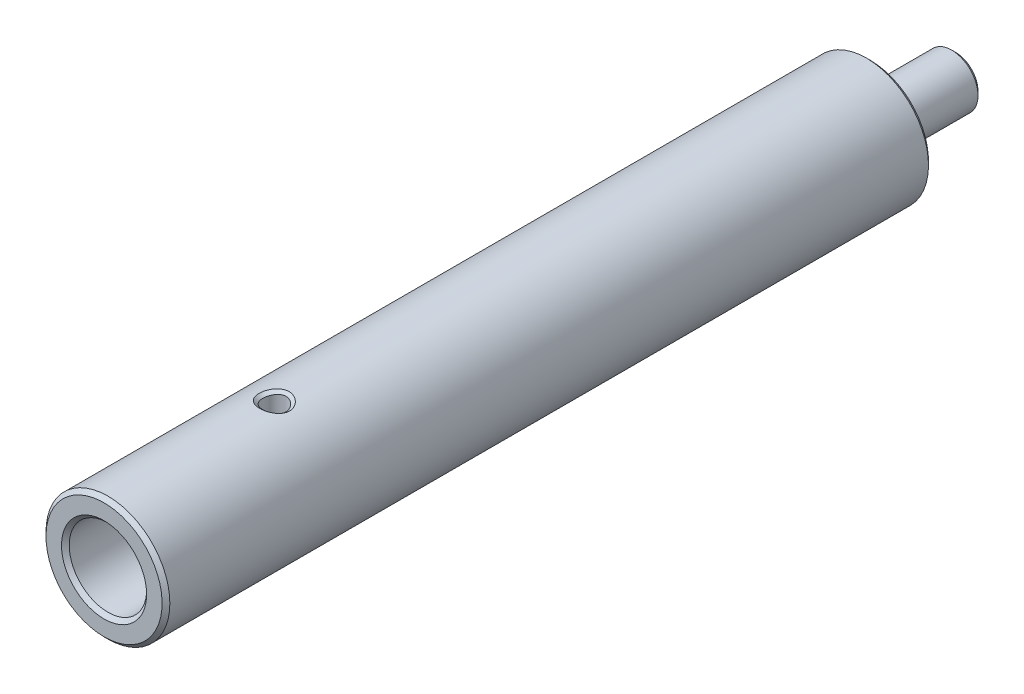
ISO-10303-21;
HEADER;
FILE_DESCRIPTION(('STEP AP214'),'2;1');
FILE_NAME('part.step','',(''),(''),'','','');
FILE_SCHEMA(('AUTOMOTIVE_DESIGN { 1 0 10303 214 1 1 1 1 }'));
ENDSEC;
DATA;
#1=APPLICATION_CONTEXT('core data for automotive mechanical design processes');
#2=APPLICATION_PROTOCOL_DEFINITION('international standard','automotive_design',2000,#1);
#3=PRODUCT_CONTEXT('',#1,'mechanical');
#4=PRODUCT('Part','Part','',(#3));
#5=PRODUCT_RELATED_PRODUCT_CATEGORY('part','',(#4));
#6=PRODUCT_DEFINITION_FORMATION('','',#4);
#7=PRODUCT_DEFINITION_CONTEXT('part definition',#1,'design');
#8=PRODUCT_DEFINITION('design','',#6,#7);
#9=PRODUCT_DEFINITION_SHAPE('','',#8);
#10=(LENGTH_UNIT() NAMED_UNIT(*) SI_UNIT(.MILLI.,.METRE.));
#11=(NAMED_UNIT(*) PLANE_ANGLE_UNIT() SI_UNIT($,.RADIAN.));
#12=(NAMED_UNIT(*) SI_UNIT($,.STERADIAN.) SOLID_ANGLE_UNIT());
#13=UNCERTAINTY_MEASURE_WITH_UNIT(LENGTH_MEASURE(1.E-05),#10,'distance_accuracy_value','');
#14=(GEOMETRIC_REPRESENTATION_CONTEXT(3) GLOBAL_UNCERTAINTY_ASSIGNED_CONTEXT((#13)) GLOBAL_UNIT_ASSIGNED_CONTEXT((#10,
#11,#12)) REPRESENTATION_CONTEXT('',''));
#15=CARTESIAN_POINT('',(0.,0.,0.));
#16=DIRECTION('',(0.,0.,1.));
#17=DIRECTION('',(1.,0.,0.));
#18=AXIS2_PLACEMENT_3D('',#15,#16,#17);
#19=CARTESIAN_POINT('',(0.,0.,0.));
#20=DIRECTION('',(0.,0.,1.));
#21=DIRECTION('',(0.,-1.,0.));
#22=AXIS2_PLACEMENT_3D('',#19,#20,#21);
#23=PLANE('',#22);
#24=CARTESIAN_POINT('',(0.,0.,0.));
#25=DIRECTION('',(0.,0.,1.));
#26=DIRECTION('',(0.,-1.,0.));
#27=AXIS2_PLACEMENT_3D('',#24,#25,#26);
#28=CIRCLE('',#27,2.24999999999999);
#29=CARTESIAN_POINT('',(0.,-2.24999999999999,0.));
#30=VERTEX_POINT('',#29);
#31=EDGE_CURVE('E42',#30,#30,#28,.T.);
#32=ORIENTED_EDGE('',*,*,#31,.T.);
#33=EDGE_LOOP('',(#32));
#34=FACE_BOUND('',#33,.T.);
#35=ADVANCED_FACE('F28',(#34),#23,.T.);
#36=CARTESIAN_POINT('',(0.,0.,-35.));
#37=DIRECTION('',(0.,0.,-1.));
#38=DIRECTION('',(0.,1.,0.));
#39=AXIS2_PLACEMENT_3D('',#36,#37,#38);
#40=CYLINDRICAL_SURFACE('',#39,2.49999999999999);
#41=CARTESIAN_POINT('',(0.,0.,19.75));
#42=DIRECTION('',(0.,0.,1.));
#43=DIRECTION('',(0.,-1.,0.));
#44=AXIS2_PLACEMENT_3D('',#41,#42,#43);
#45=CIRCLE('',#44,2.49999999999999);
#46=CARTESIAN_POINT('',(0.,-2.49999999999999,19.75));
#47=VERTEX_POINT('',#46);
#48=EDGE_CURVE('E271',#47,#47,#45,.T.);
#49=ORIENTED_EDGE('',*,*,#48,.T.);
#50=EDGE_LOOP('',(#49));
#51=FACE_BOUND('',#50,.T.);
#52=CARTESIAN_POINT('',(0.,0.,0.25));
#53=DIRECTION('',(0.,0.,1.));
#54=DIRECTION('',(0.,-1.,0.));
#55=AXIS2_PLACEMENT_3D('',#52,#53,#54);
#56=CIRCLE('',#55,2.49999999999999);
#57=CARTESIAN_POINT('',(0.,-2.49999999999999,0.25));
#58=VERTEX_POINT('',#57);
#59=EDGE_CURVE('E179',#58,#58,#56,.F.);
#60=ORIENTED_EDGE('',*,*,#59,.T.);
#61=EDGE_LOOP('',(#60));
#62=FACE_BOUND('',#61,.T.);
#63=CARTESIAN_POINT('',(0.,-2.49999999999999,10.));
#64=CARTESIAN_POINT('',(0.490810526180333,-2.50008095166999,10.0001643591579));
#65=CARTESIAN_POINT('',(0.90919669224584,-2.32884104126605,9.53946916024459));
#66=CARTESIAN_POINT('',(0.908985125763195,-2.32886385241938,8.46050326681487));
#67=CARTESIAN_POINT('',(0.490595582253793,-2.49997360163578,8.0000244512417));
#68=CARTESIAN_POINT('',(-0.490739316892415,-2.50002639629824,7.99997555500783));
#69=CARTESIAN_POINT('',(-0.909019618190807,-2.32890325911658,8.46115022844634));
#70=CARTESIAN_POINT('',(-0.909162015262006,-2.32880170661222,9.53975132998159));
#71=CARTESIAN_POINT('',(-0.490810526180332,-2.49991904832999,9.9998356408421));
#72=CARTESIAN_POINT('',(0.,-2.49999999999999,10.));
#73=B_SPLINE_CURVE_WITH_KNOTS('',3,(#63,#64,#65,#66,#67,#68,#69,#70,#71,#72),.UNSPECIFIED.,.T.,
.F.,(4,2,2,2,4),(-7.8343227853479E-06,0.001569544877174,0.00314692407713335,0.0047243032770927,
0.00630168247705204),.UNSPECIFIED.);
#74=CARTESIAN_POINT('',(0.,-2.49999999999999,10.));
#75=VERTEX_POINT('',#74);
#76=EDGE_CURVE('E177',#75,#75,#73,.F.);
#77=ORIENTED_EDGE('',*,*,#76,.T.);
#78=EDGE_LOOP('',(#77));
#79=FACE_BOUND('',#78,.T.);
#80=CARTESIAN_POINT('',(0.,2.49999999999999,10.));
#81=CARTESIAN_POINT('',(-0.490810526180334,2.50008095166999,10.0001643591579));
#82=CARTESIAN_POINT('',(-0.909196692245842,2.32884104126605,9.53946916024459));
#83=CARTESIAN_POINT('',(-0.908985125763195,2.32886385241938,8.46050326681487));
#84=CARTESIAN_POINT('',(-0.490595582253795,2.49997360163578,8.0000244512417));
#85=CARTESIAN_POINT('',(0.490739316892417,2.50002639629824,7.99997555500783));
#86=CARTESIAN_POINT('',(0.909019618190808,2.32890325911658,8.46115022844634));
#87=CARTESIAN_POINT('',(0.909162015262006,2.32880170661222,9.53975132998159));
#88=CARTESIAN_POINT('',(0.490810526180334,2.49991904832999,9.9998356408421));
#89=CARTESIAN_POINT('',(0.,2.49999999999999,10.));
#90=B_SPLINE_CURVE_WITH_KNOTS('',3,(#80,#81,#82,#83,#84,#85,#86,#87,#88,#89),.UNSPECIFIED.,.T.,
.F.,(4,2,2,2,4),(-7.8343227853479E-06,0.001569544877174,0.00314692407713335,0.0047243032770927,
0.00630168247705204),.UNSPECIFIED.);
#91=CARTESIAN_POINT('',(0.,2.49999999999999,10.));
#92=VERTEX_POINT('',#91);
#93=EDGE_CURVE('E174',#92,#92,#90,.F.);
#94=ORIENTED_EDGE('',*,*,#93,.T.);
#95=EDGE_LOOP('',(#94));
#96=FACE_BOUND('',#95,.T.);
#97=ADVANCED_FACE('F247',(#51,#62,#79,#96),#40,.F.);
#98=CARTESIAN_POINT('',(0.,2.49999999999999,20.));
#99=DIRECTION('',(0.,0.,1.));
#100=DIRECTION('',(0.,-1.,0.));
#101=AXIS2_PLACEMENT_3D('',#98,#99,#100);
#102=PLANE('',#101);
#103=CARTESIAN_POINT('',(0.,0.,20.));
#104=DIRECTION('',(0.,0.,1.));
#105=DIRECTION('',(0.,-1.,0.));
#106=AXIS2_PLACEMENT_3D('',#103,#104,#105);
#107=CIRCLE('',#106,3.74999999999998);
#108=CARTESIAN_POINT('',(0.,-3.74999999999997,20.));
#109=VERTEX_POINT('',#108);
#110=EDGE_CURVE('E186',#109,#109,#107,.T.);
#111=ORIENTED_EDGE('',*,*,#110,.T.);
#112=EDGE_LOOP('',(#111));
#113=FACE_BOUND('',#112,.T.);
#114=CARTESIAN_POINT('',(0.,0.,20.));
#115=DIRECTION('',(0.,0.,1.));
#116=DIRECTION('',(0.,-1.,0.));
#117=AXIS2_PLACEMENT_3D('',#114,#115,#116);
#118=CIRCLE('',#117,2.74999999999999);
#119=CARTESIAN_POINT('',(0.,-2.74999999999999,20.));
#120=VERTEX_POINT('',#119);
#121=EDGE_CURVE('E190',#120,#120,#118,.F.);
#122=ORIENTED_EDGE('',*,*,#121,.T.);
#123=EDGE_LOOP('',(#122));
#124=FACE_BOUND('',#123,.T.);
#125=ADVANCED_FACE('F257',(#113,#124),#102,.T.);
#126=CARTESIAN_POINT('',(0.,0.,-35.));
#127=DIRECTION('',(0.,0.,-1.));
#128=DIRECTION('',(0.,1.,0.));
#129=AXIS2_PLACEMENT_3D('',#126,#127,#128);
#130=CYLINDRICAL_SURFACE('',#129,3.99999999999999);
#131=CARTESIAN_POINT('',(0.,0.,-29.25));
#132=DIRECTION('',(0.,0.,-1.));
#133=DIRECTION('',(0.,1.,0.));
#134=AXIS2_PLACEMENT_3D('',#131,#132,#133);
#135=CIRCLE('',#134,3.99999999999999);
#136=CARTESIAN_POINT('',(0.,3.99999999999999,-29.25));
#137=VERTEX_POINT('',#136);
#138=EDGE_CURVE('E195',#137,#137,#135,.F.);
#139=ORIENTED_EDGE('',*,*,#138,.T.);
#140=EDGE_LOOP('',(#139));
#141=FACE_BOUND('',#140,.T.);
#142=CARTESIAN_POINT('',(0.,0.,19.75));
#143=DIRECTION('',(0.,0.,1.));
#144=DIRECTION('',(0.,-1.,0.));
#145=AXIS2_PLACEMENT_3D('',#142,#143,#144);
#146=CIRCLE('',#145,3.99999999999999);
#147=CARTESIAN_POINT('',(0.,-3.99999999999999,19.75));
#148=VERTEX_POINT('',#147);
#149=EDGE_CURVE('E421',#148,#148,#146,.F.);
#150=ORIENTED_EDGE('',*,*,#149,.T.);
#151=EDGE_LOOP('',(#150));
#152=FACE_BOUND('',#151,.T.);
#153=CARTESIAN_POINT('',(0.,-3.99999999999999,9.94596063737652));
#154=CARTESIAN_POINT('',(-0.529767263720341,-4.00000418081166,9.94593168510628));
#155=CARTESIAN_POINT('',(-0.986968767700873,-3.87636399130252,9.50797754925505));
#156=CARTESIAN_POINT('',(-0.98693115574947,-3.87629484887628,8.49259988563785));
#157=CARTESIAN_POINT('',(-0.530695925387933,-3.99999608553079,8.05403213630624));
#158=CARTESIAN_POINT('',(0.530811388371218,-4.00000391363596,8.05404659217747));
#159=CARTESIAN_POINT('',(0.986852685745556,-3.87629943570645,8.49298714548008));
#160=CARTESIAN_POINT('',(0.987046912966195,-3.87635948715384,9.50824214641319));
#161=CARTESIAN_POINT('',(0.529767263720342,-3.99999581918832,9.94598958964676));
#162=CARTESIAN_POINT('',(0.,-3.99999999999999,9.94596063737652));
#163=B_SPLINE_CURVE_WITH_KNOTS('',3,(#153,#154,#155,#156,#157,#158,#159,#160,#161,#162),
.UNSPECIFIED.,.T.,.F.,(4,2,2,2,4),(-0.00592829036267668,-0.00444372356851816,
-0.00295915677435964,-0.00147458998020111,9.9768139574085E-06),.UNSPECIFIED.);
#164=CARTESIAN_POINT('',(0.,-3.99999999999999,9.94596063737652));
#165=VERTEX_POINT('',#164);
#166=EDGE_CURVE('E423',#165,#165,#163,.F.);
#167=ORIENTED_EDGE('',*,*,#166,.T.);
#168=EDGE_LOOP('',(#167));
#169=FACE_BOUND('',#168,.T.);
#170=CARTESIAN_POINT('',(0.,3.99999999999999,9.94596063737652));
#171=CARTESIAN_POINT('',(0.529767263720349,4.00000418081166,9.94593168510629));
#172=CARTESIAN_POINT('',(0.986968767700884,3.87636399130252,9.50797754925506));
#173=CARTESIAN_POINT('',(0.986931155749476,3.87629484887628,8.49259988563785));
#174=CARTESIAN_POINT('',(0.530695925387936,3.9999960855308,8.05403213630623));
#175=CARTESIAN_POINT('',(-0.53081138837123,4.00000391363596,8.05404659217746));
#176=CARTESIAN_POINT('',(-0.986852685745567,3.87629943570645,8.49298714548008));
#177=CARTESIAN_POINT('',(-0.987046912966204,3.87635948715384,9.50824214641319));
#178=CARTESIAN_POINT('',(-0.529767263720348,3.99999581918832,9.94598958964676));
#179=CARTESIAN_POINT('',(0.,3.99999999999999,9.94596063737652));
#180=B_SPLINE_CURVE_WITH_KNOTS('',3,(#170,#171,#172,#173,#174,#175,#176,#177,#178,#179),
.UNSPECIFIED.,.T.,.F.,(4,2,2,2,4),(-0.00592829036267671,-0.00444372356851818,
-0.00295915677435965,-0.00147458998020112,9.97681395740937E-06),.UNSPECIFIED.);
#181=CARTESIAN_POINT('',(0.,3.99999999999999,9.94596063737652));
#182=VERTEX_POINT('',#181);
#183=EDGE_CURVE('E108',#182,#182,#180,.F.);
#184=ORIENTED_EDGE('',*,*,#183,.T.);
#185=EDGE_LOOP('',(#184));
#186=FACE_BOUND('',#185,.T.);
#187=ADVANCED_FACE('F300',(#141,#152,#169,#186),#130,.T.);
#188=CARTESIAN_POINT('',(0.,3.99999999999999,-29.5));
#189=DIRECTION('',(0.,0.,-1.));
#190=DIRECTION('',(0.,1.,0.));
#191=AXIS2_PLACEMENT_3D('',#188,#189,#190);
#192=PLANE('',#191);
#193=CARTESIAN_POINT('',(0.,0.,-29.5));
#194=DIRECTION('',(0.,0.,-1.));
#195=DIRECTION('',(0.,1.,0.));
#196=AXIS2_PLACEMENT_3D('',#193,#194,#195);
#197=CIRCLE('',#196,3.75);
#198=CARTESIAN_POINT('',(0.,3.75,-29.5));
#199=VERTEX_POINT('',#198);
#200=EDGE_CURVE('E449',#199,#199,#197,.T.);
#201=ORIENTED_EDGE('',*,*,#200,.T.);
#202=EDGE_LOOP('',(#201));
#203=FACE_BOUND('',#202,.T.);
#204=CARTESIAN_POINT('',(0.,0.,-29.5));
#205=DIRECTION('',(0.,0.,-1.));
#206=DIRECTION('',(0.,1.,0.));
#207=AXIS2_PLACEMENT_3D('',#204,#205,#206);
#208=CIRCLE('',#207,1.7);
#209=CARTESIAN_POINT('',(0.,1.7,-29.5));
#210=VERTEX_POINT('',#209);
#211=EDGE_CURVE('E452',#210,#210,#208,.T.);
#212=ORIENTED_EDGE('',*,*,#211,.F.);
#213=EDGE_LOOP('',(#212));
#214=FACE_BOUND('',#213,.T.);
#215=ADVANCED_FACE('F306',(#203,#214),#192,.T.);
#216=CARTESIAN_POINT('',(0.,0.,-35.));
#217=DIRECTION('',(0.,0.,-1.));
#218=DIRECTION('',(0.,1.,0.));
#219=AXIS2_PLACEMENT_3D('',#216,#217,#218);
#220=CYLINDRICAL_SURFACE('',#219,1.7);
#221=CARTESIAN_POINT('',(0.,0.,-34.75));
#222=DIRECTION('',(0.,0.,-1.));
#223=DIRECTION('',(0.,1.,0.));
#224=AXIS2_PLACEMENT_3D('',#221,#222,#223);
#225=CIRCLE('',#224,1.7);
#226=CARTESIAN_POINT('',(0.,1.7,-34.75));
#227=VERTEX_POINT('',#226);
#228=EDGE_CURVE('E10',#227,#227,#225,.F.);
#229=ORIENTED_EDGE('',*,*,#228,.T.);
#230=EDGE_LOOP('',(#229));
#231=FACE_BOUND('',#230,.T.);
#232=ORIENTED_EDGE('',*,*,#211,.T.);
#233=EDGE_LOOP('',(#232));
#234=FACE_BOUND('',#233,.T.);
#235=ADVANCED_FACE('F313',(#231,#234),#220,.T.);
#236=CARTESIAN_POINT('',(0.,1.7,-35.));
#237=DIRECTION('',(0.,0.,-1.));
#238=DIRECTION('',(0.,1.,0.));
#239=AXIS2_PLACEMENT_3D('',#236,#237,#238);
#240=PLANE('',#239);
#241=CARTESIAN_POINT('',(0.,0.,-35.));
#242=DIRECTION('',(0.,0.,-1.));
#243=DIRECTION('',(0.,1.,0.));
#244=AXIS2_PLACEMENT_3D('',#241,#242,#243);
#245=CIRCLE('',#244,1.44999999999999);
#246=CARTESIAN_POINT('',(0.,1.44999999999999,-35.));
#247=VERTEX_POINT('',#246);
#248=EDGE_CURVE('E37',#247,#247,#245,.T.);
#249=ORIENTED_EDGE('',*,*,#248,.T.);
#250=EDGE_LOOP('',(#249));
#251=FACE_BOUND('',#250,.T.);
#252=ADVANCED_FACE('F213',(#251),#240,.T.);
#253=CARTESIAN_POINT('',(0.,-5.,9.));
#254=DIRECTION('',(0.,1.,0.));
#255=DIRECTION('',(0.,0.,1.));
#256=AXIS2_PLACEMENT_3D('',#253,#254,#255);
#257=CYLINDRICAL_SURFACE('',#256,0.750000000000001);
#258=CARTESIAN_POINT('',(0.,-3.83387458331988,9.75));
#259=CARTESIAN_POINT('',(0.0125312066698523,-3.83387479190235,9.75000153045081));
#260=CARTESIAN_POINT('',(0.0250619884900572,-3.83375953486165,9.74966517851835));
#261=CARTESIAN_POINT('',(0.0499976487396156,-3.83331057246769,9.74832779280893));
#262=CARTESIAN_POINT('',(0.0624028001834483,-3.83297837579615,9.74733134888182));
#263=CARTESIAN_POINT('',(0.0870688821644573,-3.83211006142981,9.74469182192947));
#264=CARTESIAN_POINT('',(0.099330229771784,-3.83157505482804,9.7430522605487));
#265=CARTESIAN_POINT('',(0.123690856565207,-3.83031606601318,9.739145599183));
#266=CARTESIAN_POINT('',(0.135790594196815,-3.8295928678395,9.7368811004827));
#267=CARTESIAN_POINT('',(0.159810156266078,-3.82797223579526,9.73174318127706));
#268=CARTESIAN_POINT('',(0.171730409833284,-3.82707532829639,9.72887159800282));
#269=CARTESIAN_POINT('',(0.195373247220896,-3.82512198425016,9.7225380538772));
#270=CARTESIAN_POINT('',(0.20709618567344,-3.82406587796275,9.71907731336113));
#271=CARTESIAN_POINT('',(0.230326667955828,-3.82180877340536,9.71158382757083));
#272=CARTESIAN_POINT('',(0.241834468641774,-3.82060796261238,9.70755182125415));
#273=CARTESIAN_POINT('',(0.264616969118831,-3.81807603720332,9.69893404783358));
#274=CARTESIAN_POINT('',(0.275891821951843,-3.81674501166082,9.69434865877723));
#275=CARTESIAN_POINT('',(0.29819072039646,-3.81396720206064,9.68464224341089));
#276=CARTESIAN_POINT('',(0.309214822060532,-3.81252044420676,9.67952133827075));
#277=CARTESIAN_POINT('',(0.33099450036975,-3.80952568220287,9.66876191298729));
#278=CARTESIAN_POINT('',(0.341750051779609,-3.8079776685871,9.66312334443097));
#279=CARTESIAN_POINT('',(0.362974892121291,-3.80479488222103,9.65134652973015));
#280=CARTESIAN_POINT('',(0.37344409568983,-3.80316008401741,9.64520813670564));
#281=CARTESIAN_POINT('',(0.394078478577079,-3.79981819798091,9.63244954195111));
#282=CARTESIAN_POINT('',(0.404243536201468,-3.79811108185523,9.62582915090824));
#283=CARTESIAN_POINT('',(0.42425183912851,-3.79463901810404,9.61212437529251));
#284=CARTESIAN_POINT('',(0.434094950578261,-3.79287404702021,9.60503980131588));
#285=CARTESIAN_POINT('',(0.453441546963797,-3.78930072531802,9.59042443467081));
#286=CARTESIAN_POINT('',(0.462944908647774,-3.78749235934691,9.58289348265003));
#287=CARTESIAN_POINT('',(0.481594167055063,-3.78384669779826,9.56740310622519));
#288=CARTESIAN_POINT('',(0.490739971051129,-3.7820093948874,9.55944357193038));
#289=CARTESIAN_POINT('',(0.508656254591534,-3.77832031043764,9.54311375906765));
#290=CARTESIAN_POINT('',(0.517426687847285,-3.77646852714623,9.53474343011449));
#291=CARTESIAN_POINT('',(0.534574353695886,-3.77276493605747,9.51760974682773));
#292=CARTESIAN_POINT('',(0.542951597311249,-3.77091312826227,9.5088464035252));
#293=CARTESIAN_POINT('',(0.559294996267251,-3.76722394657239,9.49094440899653));
#294=CARTESIAN_POINT('',(0.567261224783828,-3.76538657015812,9.48180582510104));
#295=CARTESIAN_POINT('',(0.582764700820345,-3.76174071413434,9.46317107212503));
#296=CARTESIAN_POINT('',(0.59030208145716,-3.7599322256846,9.45367501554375));
#297=CARTESIAN_POINT('',(0.604929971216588,-3.75635861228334,9.43434305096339));
#298=CARTESIAN_POINT('',(0.612020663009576,-3.75459346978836,9.42450728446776));
#299=CARTESIAN_POINT('',(0.625737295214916,-3.75112101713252,9.4045136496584));
#300=CARTESIAN_POINT('',(0.632363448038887,-3.74941368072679,9.39435593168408));
#301=CARTESIAN_POINT('',(0.64513314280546,-3.74607130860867,9.37373616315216));
#302=CARTESIAN_POINT('',(0.651276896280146,-3.74443624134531,9.36327424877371));
#303=CARTESIAN_POINT('',(0.663063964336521,-3.74125287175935,9.34206387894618));
#304=CARTESIAN_POINT('',(0.668707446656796,-3.73970454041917,9.33131552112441));
#305=CARTESIAN_POINT('',(0.679476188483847,-3.73670909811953,9.30955007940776));
#306=CARTESIAN_POINT('',(0.684601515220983,-3.73526197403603,9.29853303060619));
#307=CARTESIAN_POINT('',(0.694316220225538,-3.73248338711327,9.27624804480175));
#308=CARTESIAN_POINT('',(0.698905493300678,-3.7311519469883,9.26498005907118));
#309=CARTESIAN_POINT('',(0.707530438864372,-3.72861914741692,9.24221105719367));
#310=CARTESIAN_POINT('',(0.711565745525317,-3.72741787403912,9.23070989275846));
#311=CARTESIAN_POINT('',(0.719065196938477,-3.72515979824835,9.2074924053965));
#312=CARTESIAN_POINT('',(0.722528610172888,-3.72410318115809,9.19577582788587));
#313=CARTESIAN_POINT('',(0.728866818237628,-3.72214877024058,9.17214539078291));
#314=CARTESIAN_POINT('',(0.731740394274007,-3.7212513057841,9.16023117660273));
#315=CARTESIAN_POINT('',(0.736881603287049,-3.71962950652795,9.13622333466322));
#316=CARTESIAN_POINT('',(0.739147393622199,-3.71890569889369,9.12412927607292));
#317=CARTESIAN_POINT('',(0.743055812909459,-3.71764546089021,9.09977958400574));
#318=CARTESIAN_POINT('',(0.744695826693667,-3.71710981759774,9.08752348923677));
#319=CARTESIAN_POINT('',(0.74733574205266,-3.71624010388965,9.06286752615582));
#320=CARTESIAN_POINT('',(0.74833210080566,-3.71590714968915,9.05046723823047));
#321=CARTESIAN_POINT('',(0.749667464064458,-3.71545689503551,9.02554057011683));
#322=CARTESIAN_POINT('',(0.750001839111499,-3.71534111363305,9.01301391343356));
#323=CARTESIAN_POINT('',(0.749997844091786,-3.71533938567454,8.98795973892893));
#324=CARTESIAN_POINT('',(0.749659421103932,-3.71545345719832,8.97543222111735));
#325=CARTESIAN_POINT('',(0.748318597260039,-3.71590054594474,8.95050208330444));
#326=CARTESIAN_POINT('',(0.747320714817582,-3.7162320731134,8.93809919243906));
#327=CARTESIAN_POINT('',(0.744679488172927,-3.71709910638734,8.91343639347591));
#328=CARTESIAN_POINT('',(0.743039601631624,-3.71763351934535,8.90117607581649));
#329=CARTESIAN_POINT('',(0.739133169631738,-3.7188914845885,8.87681641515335));
#330=CARTESIAN_POINT('',(0.736869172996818,-3.71961426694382,8.86471662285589));
#331=CARTESIAN_POINT('',(0.731733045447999,-3.7212341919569,8.84069590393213));
#332=CARTESIAN_POINT('',(0.728862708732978,-3.72213081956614,8.82877455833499));
#333=CARTESIAN_POINT('',(0.722532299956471,-3.72408372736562,8.80512856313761));
#334=CARTESIAN_POINT('',(0.719073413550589,-3.72513968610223,8.79340356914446));
#335=CARTESIAN_POINT('',(0.711584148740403,-3.72739660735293,8.77016806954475));
#336=CARTESIAN_POINT('',(0.707554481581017,-3.7285973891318,8.75865731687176));
#337=CARTESIAN_POINT('',(0.698941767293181,-3.73112935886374,8.73586807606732));
#338=CARTESIAN_POINT('',(0.694359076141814,-3.73246046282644,8.72458944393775));
#339=CARTESIAN_POINT('',(0.684658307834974,-3.73523852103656,8.70228222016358));
#340=CARTESIAN_POINT('',(0.679540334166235,-3.73668545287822,8.69125358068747));
#341=CARTESIAN_POINT('',(0.668786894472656,-3.73968064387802,8.66946412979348));
#342=CARTESIAN_POINT('',(0.663151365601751,-3.74122891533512,8.6587033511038));
#343=CARTESIAN_POINT('',(0.651380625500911,-3.74441228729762,8.63746742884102));
#344=CARTESIAN_POINT('',(0.64524525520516,-3.74604741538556,8.62699237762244));
#345=CARTESIAN_POINT('',(0.632492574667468,-3.7493900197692,8.60634574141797));
#346=CARTESIAN_POINT('',(0.625875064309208,-3.75109752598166,8.59617428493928));
#347=CARTESIAN_POINT('',(0.612175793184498,-3.75457041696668,8.57615269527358));
#348=CARTESIAN_POINT('',(0.605093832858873,-3.75633582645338,8.56630270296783));
#349=CARTESIAN_POINT('',(0.590483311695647,-3.75991006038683,8.54694192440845));
#350=CARTESIAN_POINT('',(0.582954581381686,-3.76171890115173,8.5374312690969));
#351=CARTESIAN_POINT('',(0.567468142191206,-3.76536553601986,8.51876707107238));
#352=CARTESIAN_POINT('',(0.559510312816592,-3.76720333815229,8.50961362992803));
#353=CARTESIAN_POINT('',(0.543183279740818,-3.77089343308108,8.49168178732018));
#354=CARTESIAN_POINT('',(0.534814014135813,-3.77274572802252,8.4829034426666));
#355=CARTESIAN_POINT('',(0.517681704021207,-3.77645034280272,8.46573973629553));
#356=CARTESIAN_POINT('',(0.508918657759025,-3.77830266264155,8.45735437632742));
#357=CARTESIAN_POINT('',(0.491016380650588,-3.78199285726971,8.44099459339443));
#358=CARTESIAN_POINT('',(0.481877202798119,-3.78383073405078,8.43302011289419));
#359=CARTESIAN_POINT('',(0.463240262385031,-3.7874775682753,8.41750004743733));
#360=CARTESIAN_POINT('',(0.453742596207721,-3.78928653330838,8.40995434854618));
#361=CARTESIAN_POINT('',(0.434406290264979,-3.79286106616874,8.395309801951));
#362=CARTESIAN_POINT('',(0.424567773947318,-3.79462664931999,8.38821079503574));
#363=CARTESIAN_POINT('',(0.404567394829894,-3.79809993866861,8.37447757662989));
#364=CARTESIAN_POINT('',(0.394405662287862,-3.79980766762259,8.36784318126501));
#365=CARTESIAN_POINT('',(0.373776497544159,-3.80315076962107,8.3550571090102));
#366=CARTESIAN_POINT('',(0.363309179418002,-3.80478616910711,8.34890525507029));
#367=CARTESIAN_POINT('',(0.342086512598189,-3.807970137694,8.33710215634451));
#368=CARTESIAN_POINT('',(0.331331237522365,-3.80951872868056,8.33145078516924));
#369=CARTESIAN_POINT('',(0.309550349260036,-3.81251461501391,8.3206664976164));
#370=CARTESIAN_POINT('',(0.298524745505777,-3.8139619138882,8.31553356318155));
#371=CARTESIAN_POINT('',(0.276220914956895,-3.81674076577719,8.30580393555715));
#372=CARTESIAN_POINT('',(0.264942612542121,-3.81807228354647,8.30120740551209));
#373=CARTESIAN_POINT('',(0.242151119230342,-3.82060514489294,8.29256829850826));
#374=CARTESIAN_POINT('',(0.230637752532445,-3.8218063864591,8.28852615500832));
#375=CARTESIAN_POINT('',(0.207393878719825,-3.82406429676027,8.28101344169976));
#376=CARTESIAN_POINT('',(0.195663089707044,-3.82512076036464,8.27754368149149));
#377=CARTESIAN_POINT('',(0.172002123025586,-3.82707475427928,8.27119324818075));
#378=CARTESIAN_POINT('',(0.160071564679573,-3.82797193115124,8.26831388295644));
#379=CARTESIAN_POINT('',(0.136028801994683,-3.82959303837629,8.26316162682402));
#380=CARTESIAN_POINT('',(0.12391614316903,-3.83031641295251,8.26089067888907));
#381=CARTESIAN_POINT('',(0.0995268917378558,-3.83157565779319,8.25697251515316));
#382=CARTESIAN_POINT('',(0.0872498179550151,-3.83211070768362,8.25532802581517));
#383=CARTESIAN_POINT('',(0.0625494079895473,-3.83297911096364,8.25267985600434));
#384=CARTESIAN_POINT('',(0.0501256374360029,-3.83331131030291,8.25167984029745));
#385=CARTESIAN_POINT('',(0.0251493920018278,-3.83375988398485,8.2503376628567));
#386=CARTESIAN_POINT('',(0.0125966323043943,-3.83387469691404,8.25000025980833));
#387=CARTESIAN_POINT('',(-0.0125090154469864,-3.83387446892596,8.24999974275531));
#388=CARTESIAN_POINT('',(-0.0250619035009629,-3.83375942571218,8.2503366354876));
#389=CARTESIAN_POINT('',(-0.0500386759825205,-3.8333104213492,8.25167710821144));
#390=CARTESIAN_POINT('',(-0.0624628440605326,-3.83297801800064,8.25267594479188));
#391=CARTESIAN_POINT('',(-0.0871642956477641,-3.83210922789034,8.25532130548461));
#392=CARTESIAN_POINT('',(-0.099442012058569,-3.8315739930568,8.25696417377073));
#393=CARTESIAN_POINT('',(-0.123832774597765,-3.83031439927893,8.26087863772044));
#394=CARTESIAN_POINT('',(-0.135946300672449,-3.8295908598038,8.26314751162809));
#395=CARTESIAN_POINT('',(-0.159991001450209,-3.82796944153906,8.26829521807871));
#396=CARTESIAN_POINT('',(-0.171922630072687,-3.82707211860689,8.27117210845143));
#397=CARTESIAN_POINT('',(-0.195585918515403,-3.82511784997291,8.27751722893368));
#398=CARTESIAN_POINT('',(-0.207317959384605,-3.82406125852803,8.28098414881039));
#399=CARTESIAN_POINT('',(-0.23056449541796,-3.82180310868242,8.28849086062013));
#400=CARTESIAN_POINT('',(-0.242079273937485,-3.8206017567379,8.29252983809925));
#401=CARTESIAN_POINT('',(-0.26487372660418,-3.8180686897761,8.30116233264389));
#402=CARTESIAN_POINT('',(-0.276153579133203,-3.81673707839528,8.30575540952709));
#403=CARTESIAN_POINT('',(-0.298460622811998,-3.81395805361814,8.31547789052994));
#404=CARTESIAN_POINT('',(-0.309487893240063,-3.81251067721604,8.3206071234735));
#405=CARTESIAN_POINT('',(-0.331272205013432,-3.80951464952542,8.33138380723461));
#406=CARTESIAN_POINT('',(-0.342029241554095,-3.80796599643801,8.33703126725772));
#407=CARTESIAN_POINT('',(-0.363255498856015,-3.8047819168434,8.34882638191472));
#408=CARTESIAN_POINT('',(-0.373724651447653,-3.80314647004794,8.3549741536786));
#409=CARTESIAN_POINT('',(-0.394357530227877,-3.79980328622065,8.36775193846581));
#410=CARTESIAN_POINT('',(-0.404521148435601,-3.79809552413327,8.37438211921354));
#411=CARTESIAN_POINT('',(-0.424525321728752,-3.79462218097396,8.38810682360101));
#412=CARTESIAN_POINT('',(-0.434365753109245,-3.79285657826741,8.39520152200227));
#413=CARTESIAN_POINT('',(-0.453705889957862,-3.78928201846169,8.40983740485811));
#414=CARTESIAN_POINT('',(-0.463205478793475,-3.78747304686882,8.41737873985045));
#415=CARTESIAN_POINT('',(-0.481846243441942,-3.78382621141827,8.43289006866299));
#416=CARTESIAN_POINT('',(-0.490987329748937,-3.78198834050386,8.44086016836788));
#417=CARTESIAN_POINT('',(-0.508893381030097,-3.77829816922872,8.45721121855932));
#418=CARTESIAN_POINT('',(-0.517658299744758,-3.7764458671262,8.46559221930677));
#419=CARTESIAN_POINT('',(-0.534794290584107,-3.77274129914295,8.48274727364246));
#420=CARTESIAN_POINT('',(-0.543165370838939,-3.77088903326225,8.49152131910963));
#421=CARTESIAN_POINT('',(-0.559495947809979,-3.76719900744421,8.50944466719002));
#422=CARTESIAN_POINT('',(-0.567455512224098,-3.76536124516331,8.5185939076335));
#423=CARTESIAN_POINT('',(-0.582945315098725,-3.7617147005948,8.53724984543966));
#424=CARTESIAN_POINT('',(-0.590475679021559,-3.75990590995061,8.54675643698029));
#425=CARTESIAN_POINT('',(-0.605089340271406,-3.75633178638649,8.56610926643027));
#426=CARTESIAN_POINT('',(-0.612172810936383,-3.75456643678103,8.57595537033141));
#427=CARTESIAN_POINT('',(-0.625874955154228,-3.75109367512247,8.59596939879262));
#428=CARTESIAN_POINT('',(-0.632493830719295,-3.74938623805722,8.60613718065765));
#429=CARTESIAN_POINT('',(-0.645249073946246,-3.74604378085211,8.62677672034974));
#430=CARTESIAN_POINT('',(-0.651385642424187,-3.744408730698,8.63724834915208));
#431=CARTESIAN_POINT('',(-0.663158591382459,-3.7412255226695,8.658477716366));
#432=CARTESIAN_POINT('',(-0.668795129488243,-3.73967733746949,8.66923536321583));
#433=CARTESIAN_POINT('',(-0.679550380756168,-3.73668232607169,8.691018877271));
#434=CARTESIAN_POINT('',(-0.684669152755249,-3.73523548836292,8.70204471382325));
#435=CARTESIAN_POINT('',(-0.694371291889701,-3.73245762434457,8.7243466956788));
#436=CARTESIAN_POINT('',(-0.698954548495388,-3.73112662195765,8.73562289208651));
#437=CARTESIAN_POINT('',(-0.707568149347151,-3.72859485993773,8.75840766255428));
#438=CARTESIAN_POINT('',(-0.711598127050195,-3.72739418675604,8.76991638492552));
#439=CARTESIAN_POINT('',(-0.719087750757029,-3.7251374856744,8.79314826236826));
#440=CARTESIAN_POINT('',(-0.722546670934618,-3.72408164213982,8.80487166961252));
#441=CARTESIAN_POINT('',(-0.728876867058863,-3.72212896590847,8.82851496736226));
#442=CARTESIAN_POINT('',(-0.731746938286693,-3.72123245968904,8.84043520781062));
#443=CARTESIAN_POINT('',(-0.736882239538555,-3.71961277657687,8.86445423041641));
#444=CARTESIAN_POINT('',(-0.739145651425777,-3.71889012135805,8.87655343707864));
#445=CARTESIAN_POINT('',(-0.743050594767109,-3.7176324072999,8.90091247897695));
#446=CARTESIAN_POINT('',(-0.74468954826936,-3.71709812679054,8.9131727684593));
#447=CARTESIAN_POINT('',(-0.747328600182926,-3.71623135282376,8.93783610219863));
#448=CARTESIAN_POINT('',(-0.748325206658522,-3.71589996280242,8.95023955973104));
#449=CARTESIAN_POINT('',(-0.749663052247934,-3.71545314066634,8.97517146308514));
#450=CARTESIAN_POINT('',(-0.749999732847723,-3.71533921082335,8.98770018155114));
#451=CARTESIAN_POINT('',(-0.750000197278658,-3.71534120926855,9.01275718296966));
#452=CARTESIAN_POINT('',(-0.749664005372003,-3.71545712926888,9.02528546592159));
#453=CARTESIAN_POINT('',(-0.748325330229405,-3.71590765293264,9.05021559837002));
#454=CARTESIAN_POINT('',(-0.747327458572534,-3.71624074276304,9.06261772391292));
#455=CARTESIAN_POINT('',(-0.744684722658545,-3.71711072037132,9.0872775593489));
#456=CARTESIAN_POINT('',(-0.743043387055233,-3.71764649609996,9.09953568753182));
#457=CARTESIAN_POINT('',(-0.739132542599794,-3.71890699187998,9.12388963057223));
#458=CARTESIAN_POINT('',(-0.736865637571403,-3.71963092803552,9.1359859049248));
#459=CARTESIAN_POINT('',(-0.73172239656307,-3.72125297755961,9.15999834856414));
#460=CARTESIAN_POINT('',(-0.72884789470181,-3.72215056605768,9.17191494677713));
#461=CARTESIAN_POINT('',(-0.722508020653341,-3.72410521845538,9.19555030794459));
#462=CARTESIAN_POINT('',(-0.719043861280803,-3.72516195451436,9.2072694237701));
#463=CARTESIAN_POINT('',(-0.711543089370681,-3.72742026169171,9.23049212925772));
#464=CARTESIAN_POINT('',(-0.707507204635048,-3.72862164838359,9.24199597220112));
#465=CARTESIAN_POINT('',(-0.698881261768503,-3.7311546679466,9.26477045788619));
#466=CARTESIAN_POINT('',(-0.694291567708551,-3.73248621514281,9.2760412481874));
#467=CARTESIAN_POINT('',(-0.684576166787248,-3.73526500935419,9.29833195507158));
#468=CARTESIAN_POINT('',(-0.67945056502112,-3.73671223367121,9.30935192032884));
#469=CARTESIAN_POINT('',(-0.668681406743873,-3.73970786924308,9.33112329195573));
#470=CARTESIAN_POINT('',(-0.663037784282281,-3.74125629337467,9.34187466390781));
#471=CARTESIAN_POINT('',(-0.651250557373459,-3.74443984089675,9.36309114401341));
#472=CARTESIAN_POINT('',(-0.645106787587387,-3.746074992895,9.37355615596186));
#473=CARTESIAN_POINT('',(-0.632337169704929,-3.74941752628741,9.39418218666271));
#474=CARTESIAN_POINT('',(-0.62571111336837,-3.75112493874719,9.40434307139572));
#475=CARTESIAN_POINT('',(-0.611994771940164,-3.75459753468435,9.42434309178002));
#476=CARTESIAN_POINT('',(-0.604904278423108,-3.756362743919,9.43418207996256));
#477=CARTESIAN_POINT('',(-0.590276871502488,-3.75993648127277,9.45352052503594));
#478=CARTESIAN_POINT('',(-0.582739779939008,-3.76174502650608,9.46301984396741));
#479=CARTESIAN_POINT('',(-0.567236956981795,-3.76539098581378,9.48166114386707));
#480=CARTESIAN_POINT('',(-0.559271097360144,-3.76722840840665,9.49080301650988));
#481=CARTESIAN_POINT('',(-0.54292849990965,-3.77091767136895,9.50871159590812));
#482=CARTESIAN_POINT('',(-0.53455169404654,-3.77276951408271,9.51747824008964));
#483=CARTESIAN_POINT('',(-0.517404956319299,-3.7764731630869,9.53461851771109));
#484=CARTESIAN_POINT('',(-0.508635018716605,-3.77832496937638,9.54299214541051));
#485=CARTESIAN_POINT('',(-0.490719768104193,-3.78201408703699,9.55932853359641));
#486=CARTESIAN_POINT('',(-0.481574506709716,-3.78385140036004,9.56729135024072));
#487=CARTESIAN_POINT('',(-0.462926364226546,-3.78749706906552,9.58278825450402));
#488=CARTESIAN_POINT('',(-0.453423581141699,-3.78930543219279,9.59032245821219));
#489=CARTESIAN_POINT('',(-0.434078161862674,-3.79287873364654,9.6049442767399));
#490=CARTESIAN_POINT('',(-0.424235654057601,-3.79464368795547,9.61203205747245));
#491=CARTESIAN_POINT('',(-0.404228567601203,-3.79811570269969,9.62574318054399));
#492=CARTESIAN_POINT('',(-0.394064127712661,-3.79982278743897,9.63236671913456));
#493=CARTESIAN_POINT('',(-0.373430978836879,-3.80316459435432,9.64513152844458));
#494=CARTESIAN_POINT('',(-0.362962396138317,-3.80479934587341,9.65127299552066));
#495=CARTESIAN_POINT('',(-0.341738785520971,-3.80798202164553,9.66305586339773));
#496=CARTESIAN_POINT('',(-0.330983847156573,-3.80952997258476,9.6686974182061));
#497=CARTESIAN_POINT('',(-0.309205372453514,-3.81252459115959,9.67946270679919));
#498=CARTESIAN_POINT('',(-0.298181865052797,-3.81397126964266,9.68458649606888));
#499=CARTESIAN_POINT('',(-0.275884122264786,-3.81674890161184,9.69429855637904));
#500=CARTESIAN_POINT('',(-0.264609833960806,-3.81807983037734,9.69888671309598));
#501=CARTESIAN_POINT('',(-0.241828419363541,-3.82061154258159,9.70750988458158));
#502=CARTESIAN_POINT('',(-0.230321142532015,-3.82181223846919,9.71154452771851));
#503=CARTESIAN_POINT('',(-0.207091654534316,-3.82406909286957,9.7190431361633));
#504=CARTESIAN_POINT('',(-0.195369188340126,-3.82512506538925,9.72250636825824));
#505=CARTESIAN_POINT('',(-0.17172723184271,-3.82707812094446,9.72884473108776));
#506=CARTESIAN_POINT('',(-0.159807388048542,-3.82797487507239,9.73171864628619));
#507=CARTESIAN_POINT('',(-0.135788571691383,-3.82959517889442,9.73686105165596));
#508=CARTESIAN_POINT('',(-0.123689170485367,-3.83031820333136,9.73912770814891));
#509=CARTESIAN_POINT('',(-0.0993291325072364,-3.83157682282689,9.7430384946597));
#510=CARTESIAN_POINT('',(-0.0870680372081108,-3.83211163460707,9.74468002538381));
#511=CARTESIAN_POINT('',(-0.062402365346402,-3.83297953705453,9.74732328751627));
#512=CARTESIAN_POINT('',(-0.0499973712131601,-3.83331151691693,9.74832149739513));
#513=CARTESIAN_POINT('',(-0.0250619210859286,-3.83376002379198,9.74966220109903));
#514=CARTESIAN_POINT('',(-0.0125311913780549,-3.83387504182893,9.7500001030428));
#515=CARTESIAN_POINT('',(0.,-3.83387458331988,9.75));
#516=B_SPLINE_CURVE_WITH_KNOTS('',3,(#258,#259,#260,#261,#262,#263,#264,#265,#266,#267,#268,
#269,#270,#271,#272,#273,#274,#275,#276,#277,#278,#279,#280,#281,#282,#283,#284,#285,#286,#287,
#288,#289,#290,#291,#292,#293,#294,#295,#296,#297,#298,#299,#300,#301,#302,#303,#304,#305,#306,
#307,#308,#309,#310,#311,#312,#313,#314,#315,#316,#317,#318,#319,#320,#321,#322,#323,#324,#325,
#326,#327,#328,#329,#330,#331,#332,#333,#334,#335,#336,#337,#338,#339,#340,#341,#342,#343,#344,
#345,#346,#347,#348,#349,#350,#351,#352,#353,#354,#355,#356,#357,#358,#359,#360,#361,#362,#363,
#364,#365,#366,#367,#368,#369,#370,#371,#372,#373,#374,#375,#376,#377,#378,#379,#380,#381,#382,
#383,#384,#385,#386,#387,#388,#389,#390,#391,#392,#393,#394,#395,#396,#397,#398,#399,#400,#401,
#402,#403,#404,#405,#406,#407,#408,#409,#410,#411,#412,#413,#414,#415,#416,#417,#418,#419,#420,
#421,#422,#423,#424,#425,#426,#427,#428,#429,#430,#431,#432,#433,#434,#435,#436,#437,#438,#439,
#440,#441,#442,#443,#444,#445,#446,#447,#448,#449,#450,#451,#452,#453,#454,#455,#456,#457,#458,
#459,#460,#461,#462,#463,#464,#465,#466,#467,#468,#469,#470,#471,#472,#473,#474,#475,#476,#477,
#478,#479,#480,#481,#482,#483,#484,#485,#486,#487,#488,#489,#490,#491,#492,#493,#494,#495,#496,
#497,#498,#499,#500,#501,#502,#503,#504,#505,#506,#507,#508,#509,#510,#511,#512,#513,#514,#515),
.UNSPECIFIED.,.F.,.F.,(4,2,2,2,2,2,2,2,2,2,2,2,2,2,2,2,2,2,2,2,2,2,2,2,2,2,2,2,2,2,2,2,2,2,2,2,
2,2,2,2,2,2,2,2,2,2,2,2,2,2,2,2,2,2,2,2,2,2,2,2,2,2,2,2,2,2,2,2,2,2,2,2,2,2,2,2,2,2,2,2,2,2,2,2,
2,2,2,2,2,2,2,2,2,2,2,2,2,2,2,2,2,2,2,2,2,2,2,2,2,2,2,2,2,2,2,2,2,2,2,2,2,2,2,2,2,2,2,2,4),(0.,
0.0375878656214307,0.0749170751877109,0.112044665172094,0.149019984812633,0.18588496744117,
0.222674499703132,0.259416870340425,0.296134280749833,0.332843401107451,0.369555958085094,
0.4062793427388,0.443017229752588,0.479770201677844,0.516536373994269,0.553312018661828,
0.590092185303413,0.62687132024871,0.663643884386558,0.700404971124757,0.737150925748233,
0.773879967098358,0.810592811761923,0.847293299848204,0.883989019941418,0.920691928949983,
0.95741896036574,0.994192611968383,1.03104150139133,1.06800087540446,1.10511305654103,
1.14242780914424,1.18000260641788,1.21758035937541,1.25490327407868,1.29202788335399,
1.32900306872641,1.36587033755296,1.40266419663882,1.43941260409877,1.47613748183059,
1.51285527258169,1.54957752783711,1.58631151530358,1.62306083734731,1.6598260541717,
1.69660530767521,1.73339494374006,1.77019013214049,1.80698548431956,1.84377566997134,
1.88055603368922,1.91732321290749,1.95407575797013,1.9908147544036,2.0275444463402,
2.06427285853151,2.10101241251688,2.13778053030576,2.17460021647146,2.21150060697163,
2.24851747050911,2.28569364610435,2.3230793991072,2.36073267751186,2.39838633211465,
2.43577304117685,2.47295052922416,2.50996885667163,2.54687067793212,2.58369159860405,
2.62046061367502,2.65720060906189,2.69392891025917,2.73065786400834,2.76739544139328,
2.80414585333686,2.84091017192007,2.87768695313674,2.91447285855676,2.95126327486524,
2.9880529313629,3.02483651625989,3.06160929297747,3.09836771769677,3.13511005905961,
3.1718370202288,3.2085523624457,3.24526352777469,3.28198225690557,3.31872519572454,
3.35551448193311,3.39237830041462,3.42935139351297,3.46647551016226,3.5037997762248,
3.54138096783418,3.57896080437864,3.61628144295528,3.65340022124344,3.69036677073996,
3.72722328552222,3.76400488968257,3.80074008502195,3.83745126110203,3.87415525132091,
3.91086392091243,3.9475847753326,3.98432158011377,4.02107498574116,4.05784315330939,
4.09462237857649,4.13140771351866,4.16819358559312,4.20497441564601,4.24174523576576,
4.27850230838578,4.31524374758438,4.35197014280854,4.38868518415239,4.42539628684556,
4.46211521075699,4.49885866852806,4.53564891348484,4.57251429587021,4.60948977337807,
4.64661735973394,4.68394649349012,4.7215343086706),.UNSPECIFIED.);
#517=CARTESIAN_POINT('',(0.,-3.83387458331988,9.75));
#518=VERTEX_POINT('',#517);
#519=EDGE_CURVE('E50',#518,#518,#516,.F.);
#520=ORIENTED_EDGE('',*,*,#519,.T.);
#521=EDGE_LOOP('',(#520));
#522=FACE_BOUND('',#521,.T.);
#523=CARTESIAN_POINT('',(0.,-2.74999999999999,9.75));
#524=CARTESIAN_POINT('',(-0.0126008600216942,-2.74999786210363,9.74999716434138));
#525=CARTESIAN_POINT('',(-0.0252008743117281,-2.74981226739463,9.74965832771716));
#526=CARTESIAN_POINT('',(-0.0502662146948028,-2.74909418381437,9.7483197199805));
#527=CARTESIAN_POINT('',(-0.0627318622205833,-2.74856416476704,9.74732465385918));
#528=CARTESIAN_POINT('',(-0.0875104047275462,-2.74718034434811,9.74469131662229));
#529=CARTESIAN_POINT('',(-0.0998237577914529,-2.74632825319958,9.74305644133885));
#530=CARTESIAN_POINT('',(-0.124280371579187,-2.74432417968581,9.73916249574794));
#531=CARTESIAN_POINT('',(-0.136424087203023,-2.74317329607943,9.73690571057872));
#532=CARTESIAN_POINT('',(-0.160524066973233,-2.74059512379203,9.73178634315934));
#533=CARTESIAN_POINT('',(-0.172480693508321,-2.73916846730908,9.72892514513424));
#534=CARTESIAN_POINT('',(-0.19618925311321,-2.73606215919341,9.72261524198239));
#535=CARTESIAN_POINT('',(-0.207941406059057,-2.73438280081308,9.71916721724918));
#536=CARTESIAN_POINT('',(-0.2312238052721,-2.73079435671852,9.71170172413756));
#537=CARTESIAN_POINT('',(-0.24275411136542,-2.72888533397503,9.70768441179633));
#538=CARTESIAN_POINT('',(-0.265575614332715,-2.72486072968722,9.69909823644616));
#539=CARTESIAN_POINT('',(-0.276866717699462,-2.72274506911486,9.6945291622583));
#540=CARTESIAN_POINT('',(-0.29919259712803,-2.71833027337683,9.68485720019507));
#541=CARTESIAN_POINT('',(-0.310227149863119,-2.71603098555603,9.67975386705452));
#542=CARTESIAN_POINT('',(-0.332022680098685,-2.71127195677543,9.66903099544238));
#543=CARTESIAN_POINT('',(-0.342783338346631,-2.70881203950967,9.66341088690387));
#544=CARTESIAN_POINT('',(-0.364013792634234,-2.70375472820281,9.65167196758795));
#545=CARTESIAN_POINT('',(-0.374483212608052,-2.70115716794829,9.64555254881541));
#546=CARTESIAN_POINT('',(-0.39511386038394,-2.69584751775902,9.6328324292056));
#547=CARTESIAN_POINT('',(-0.40527469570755,-2.69313529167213,9.62623114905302));
#548=CARTESIAN_POINT('',(-0.425270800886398,-2.68761924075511,9.61256466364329));
#549=CARTESIAN_POINT('',(-0.435105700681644,-2.68481531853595,9.60549895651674));
#550=CARTESIAN_POINT('',(-0.454432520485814,-2.67913880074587,9.5909209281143));
#551=CARTESIAN_POINT('',(-0.463924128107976,-2.67626614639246,9.58340821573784));
#552=CARTESIAN_POINT('',(-0.482546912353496,-2.6704750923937,9.56795345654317));
#553=CARTESIAN_POINT('',(-0.491677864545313,-2.66755666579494,9.56001114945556));
#554=CARTESIAN_POINT('',(-0.509561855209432,-2.66169700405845,9.54371446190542));
#555=CARTESIAN_POINT('',(-0.51831478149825,-2.65875576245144,9.53535996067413));
#556=CARTESIAN_POINT('',(-0.535425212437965,-2.65287342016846,9.51825613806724));
#557=CARTESIAN_POINT('',(-0.543782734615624,-2.64993231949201,9.50950683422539));
#558=CARTESIAN_POINT('',(-0.560084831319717,-2.64407322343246,9.49163066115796));
#559=CARTESIAN_POINT('',(-0.568029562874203,-2.64115521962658,9.4825039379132));
#560=CARTESIAN_POINT('',(-0.583488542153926,-2.63536529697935,9.4638901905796));
#561=CARTESIAN_POINT('',(-0.591003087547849,-2.63249334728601,9.45440342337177));
#562=CARTESIAN_POINT('',(-0.605584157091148,-2.62681852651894,9.43508686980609));
#563=CARTESIAN_POINT('',(-0.61265111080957,-2.62401559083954,9.42525742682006));
#564=CARTESIAN_POINT('',(-0.626319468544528,-2.61850180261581,9.40527282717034));
#565=CARTESIAN_POINT('',(-0.632921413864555,-2.61579084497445,9.39511806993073));
#566=CARTESIAN_POINT('',(-0.6456422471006,-2.61048402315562,9.37450017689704));
#567=CARTESIAN_POINT('',(-0.651761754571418,-2.60788801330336,9.36403746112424));
#568=CARTESIAN_POINT('',(-0.663500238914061,-2.60283409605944,9.34282102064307));
#569=CARTESIAN_POINT('',(-0.669119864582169,-2.60037601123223,9.33206769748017));
#570=CARTESIAN_POINT('',(-0.679841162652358,-2.59562094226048,9.31028745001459));
#571=CARTESIAN_POINT('',(-0.684943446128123,-2.59332376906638,9.29926086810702));
#572=CARTESIAN_POINT('',(-0.69461270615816,-2.58891349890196,9.27695154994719));
#573=CARTESIAN_POINT('',(-0.699180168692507,-2.58680023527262,9.26566905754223));
#574=CARTESIAN_POINT('',(-0.707762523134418,-2.58278072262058,9.24286540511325));
#575=CARTESIAN_POINT('',(-0.711777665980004,-2.58087437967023,9.23134435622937));
#576=CARTESIAN_POINT('',(-0.719238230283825,-2.57729159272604,9.20808110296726));
#577=CARTESIAN_POINT('',(-0.722683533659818,-2.57561519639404,9.19633885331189));
#578=CARTESIAN_POINT('',(-0.728987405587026,-2.57251511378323,9.17265075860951));
#579=CARTESIAN_POINT('',(-0.731845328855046,-2.57109170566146,9.1607047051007));
#580=CARTESIAN_POINT('',(-0.736957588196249,-2.56852031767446,9.13662646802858));
#581=CARTESIAN_POINT('',(-0.739210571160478,-2.56737295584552,9.12449393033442));
#582=CARTESIAN_POINT('',(-0.743096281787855,-2.56537626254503,9.10006053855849));
#583=CARTESIAN_POINT('',(-0.744726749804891,-2.56452801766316,9.08775923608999));
#584=CARTESIAN_POINT('',(-0.747350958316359,-2.56315203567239,9.06300468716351));
#585=CARTESIAN_POINT('',(-0.748341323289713,-2.56262599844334,9.05055098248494));
#586=CARTESIAN_POINT('',(-0.749335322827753,-2.56209501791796,9.03180682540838));
#587=CARTESIAN_POINT('',(-0.74958473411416,-2.56196102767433,9.02553192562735));
#588=CARTESIAN_POINT('',(-0.749917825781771,-2.56178177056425,9.01295072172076));
#589=CARTESIAN_POINT('',(-0.750000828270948,-2.56173686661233,9.00664439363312));
#590=CARTESIAN_POINT('',(-0.749999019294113,-2.56173859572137,8.9940315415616));
#591=CARTESIAN_POINT('',(-0.749914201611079,-2.56178523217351,8.98772501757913));
#592=CARTESIAN_POINT('',(-0.749577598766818,-2.56196788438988,8.9751430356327));
#593=CARTESIAN_POINT('',(-0.749326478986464,-2.56210354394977,8.96886755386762));
#594=CARTESIAN_POINT('',(-0.748327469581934,-2.56263945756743,8.95012046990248));
#595=CARTESIAN_POINT('',(-0.747333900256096,-2.56316870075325,8.93766451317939));
#596=CARTESIAN_POINT('',(-0.744703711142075,-2.5645508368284,8.91290407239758));
#597=CARTESIAN_POINT('',(-0.743070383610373,-2.56540207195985,8.90059914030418));
#598=CARTESIAN_POINT('',(-0.739179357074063,-2.56740449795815,8.87615720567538));
#599=CARTESIAN_POINT('',(-0.73692384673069,-2.56855463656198,8.86401976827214));
#600=CARTESIAN_POINT('',(-0.731806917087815,-2.57113133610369,8.83993055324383));
#601=CARTESIAN_POINT('',(-0.728946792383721,-2.57255730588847,8.82797843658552));
#602=CARTESIAN_POINT('',(-0.722638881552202,-2.57566227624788,8.80427714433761));
#603=CARTESIAN_POINT('',(-0.71919169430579,-2.57734101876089,8.79252777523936));
#604=CARTESIAN_POINT('',(-0.711727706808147,-2.58092826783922,8.76924932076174));
#605=CARTESIAN_POINT('',(-0.707710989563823,-2.58283674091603,8.75772020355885));
#606=CARTESIAN_POINT('',(-0.699125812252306,-2.5868602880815,8.73489956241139));
#607=CARTESIAN_POINT('',(-0.694557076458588,-2.58897546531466,8.72360816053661));
#608=CARTESIAN_POINT('',(-0.684885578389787,-2.59338934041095,8.70128028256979));
#609=CARTESIAN_POINT('',(-0.679782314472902,-2.59568821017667,8.69024405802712));
#610=CARTESIAN_POINT('',(-0.669059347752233,-2.6004464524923,8.66844389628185));
#611=CARTESIAN_POINT('',(-0.663439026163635,-2.60290601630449,8.65768030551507));
#612=CARTESIAN_POINT('',(-0.651699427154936,-2.60796267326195,8.63644281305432));
#613=CARTESIAN_POINT('',(-0.645579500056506,-2.61055994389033,8.62596931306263));
#614=CARTESIAN_POINT('',(-0.63285809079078,-2.61586906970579,8.60532944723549));
#615=CARTESIAN_POINT('',(-0.626255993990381,-2.61858106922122,8.59516349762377));
#616=CARTESIAN_POINT('',(-0.612587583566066,-2.62409672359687,8.57515622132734));
#617=CARTESIAN_POINT('',(-0.605520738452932,-2.62690048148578,8.56531528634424));
#618=CARTESIAN_POINT('',(-0.590940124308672,-2.63257672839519,8.54597556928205));
#619=CARTESIAN_POINT('',(-0.58342593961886,-2.63544927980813,8.53647711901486));
#620=CARTESIAN_POINT('',(-0.567967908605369,-2.64124018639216,8.51783993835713));
#621=CARTESIAN_POINT('',(-0.560023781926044,-2.64415857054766,8.50870144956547));
#622=CARTESIAN_POINT('',(-0.543723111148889,-2.65001820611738,8.49080179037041));
#623=CARTESIAN_POINT('',(-0.535366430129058,-2.65295946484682,8.48204074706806));
#624=CARTESIAN_POINT('',(-0.518257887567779,-2.65884189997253,8.46491360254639));
#625=CARTESIAN_POINT('',(-0.509506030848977,-2.66178307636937,8.45654749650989));
#626=CARTESIAN_POINT('',(-0.491624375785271,-2.6676423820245,8.44022786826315));
#627=CARTESIAN_POINT('',(-0.482494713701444,-2.67056051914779,8.43227419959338));
#628=CARTESIAN_POINT('',(-0.46387469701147,-2.67635076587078,8.41679709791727));
#629=CARTESIAN_POINT('',(-0.454384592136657,-2.67922290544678,8.40927337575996));
#630=CARTESIAN_POINT('',(-0.435060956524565,-2.6848981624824,8.39467382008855));
#631=CARTESIAN_POINT('',(-0.425227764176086,-2.68770134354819,8.38759756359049));
#632=CARTESIAN_POINT('',(-0.405235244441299,-2.69321567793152,8.37391058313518));
#633=CARTESIAN_POINT('',(-0.395076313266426,-2.69592693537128,8.36729932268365));
#634=CARTESIAN_POINT('',(-0.374449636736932,-2.70123441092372,8.35455995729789));
#635=CARTESIAN_POINT('',(-0.363982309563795,-2.70383077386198,8.34843123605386));
#636=CARTESIAN_POINT('',(-0.342756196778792,-2.70888545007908,8.3366745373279));
#637=CARTESIAN_POINT('',(-0.331997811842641,-2.71134394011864,8.33104591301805));
#638=CARTESIAN_POINT('',(-0.310206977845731,-2.71609987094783,8.32030694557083));
#639=CARTESIAN_POINT('',(-0.299174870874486,-2.71839750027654,8.31519599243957));
#640=CARTESIAN_POINT('',(-0.276854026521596,-2.72280873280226,8.30550983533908));
#641=CARTESIAN_POINT('',(-0.265565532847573,-2.72492250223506,8.30093414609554));
#642=CARTESIAN_POINT('',(-0.24274938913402,-2.72894307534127,8.29233589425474));
#643=CARTESIAN_POINT('',(-0.231221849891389,-2.73084997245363,8.28831308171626));
#644=CARTESIAN_POINT('',(-0.2079451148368,-2.73443391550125,8.28083784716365));
#645=CARTESIAN_POINT('',(-0.196195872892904,-2.73611091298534,8.2773855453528));
#646=CARTESIAN_POINT('',(-0.172493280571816,-2.73921224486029,8.27106845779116));
#647=CARTESIAN_POINT('',(-0.160539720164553,-2.74063629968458,8.26820432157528));
#648=CARTESIAN_POINT('',(-0.136445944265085,-2.74320902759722,8.26308052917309));
#649=CARTESIAN_POINT('',(-0.124305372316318,-2.74435708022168,8.26082223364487));
#650=CARTESIAN_POINT('',(-0.0998553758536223,-2.74635520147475,8.2569268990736));
#651=CARTESIAN_POINT('',(-0.0875455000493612,-2.74720417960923,8.25529213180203));
#652=CARTESIAN_POINT('',(-0.062773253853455,-2.7485816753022,8.25266044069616));
#653=CARTESIAN_POINT('',(-0.0503104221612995,-2.7491084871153,8.25166691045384));
#654=CARTESIAN_POINT('',(-0.0315523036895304,-2.74964065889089,8.25066907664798));
#655=CARTESIAN_POINT('',(-0.0252726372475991,-2.74977505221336,8.25041853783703));
#656=CARTESIAN_POINT('',(-0.0126817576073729,-2.74995512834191,8.25008353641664));
#657=CARTESIAN_POINT('',(-0.0063705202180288,-2.75000044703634,8.24999975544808));
#658=CARTESIAN_POINT('',(0.00625197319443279,-2.74999955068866,8.25000024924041));
#659=CARTESIAN_POINT('',(0.0125632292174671,-2.74995333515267,8.25008452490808));
#660=CARTESIAN_POINT('',(0.0251541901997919,-2.74977150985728,8.25042017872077));
#661=CARTESIAN_POINT('',(0.0314339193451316,-2.74963626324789,8.25067087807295));
#662=CARTESIAN_POINT('',(0.0501923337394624,-2.7491015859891,8.25166882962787));
#663=CARTESIAN_POINT('',(0.0626553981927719,-2.74857316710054,8.25266195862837));
#664=CARTESIAN_POINT('',(0.0874282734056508,-2.74719259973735,8.25529187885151));
#665=CARTESIAN_POINT('',(0.0997385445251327,-2.7463421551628,8.25692528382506));
#666=CARTESIAN_POINT('',(0.124189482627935,-2.74434123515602,8.26081702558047));
#667=CARTESIAN_POINT('',(0.136330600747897,-2.74319185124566,8.26307309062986));
#668=CARTESIAN_POINT('',(0.160425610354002,-2.7406165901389,8.26819163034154));
#669=CARTESIAN_POINT('',(0.172379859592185,-2.73919133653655,8.2710527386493));
#670=CARTESIAN_POINT('',(0.196083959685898,-2.7360877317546,8.27736305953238));
#671=CARTESIAN_POINT('',(0.207834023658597,-2.73440966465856,8.28081161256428));
#672=CARTESIAN_POINT('',(0.23111252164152,-2.73082370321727,8.28827871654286));
#673=CARTESIAN_POINT('',(0.242641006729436,-2.72891586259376,8.29229713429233));
#674=CARTESIAN_POINT('',(0.265459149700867,-2.72489352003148,8.30088604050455));
#675=CARTESIAN_POINT('',(0.276748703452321,-2.72277893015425,8.30545676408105));
#676=CARTESIAN_POINT('',(0.299071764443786,-2.71836617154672,8.31513250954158));
#677=CARTESIAN_POINT('',(0.310105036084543,-2.71606784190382,8.32023800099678));
#678=CARTESIAN_POINT('',(0.331898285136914,-2.71131062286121,8.33096563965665));
#679=CARTESIAN_POINT('',(0.34265792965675,-2.70885154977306,8.33658838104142));
#680=CARTESIAN_POINT('',(0.363886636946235,-2.70379581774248,8.34833298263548));
#681=CARTESIAN_POINT('',(0.374355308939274,-2.70119898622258,8.35445547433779));
#682=CARTESIAN_POINT('',(0.39498474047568,-2.69589068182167,8.367182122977));
#683=CARTESIAN_POINT('',(0.405145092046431,-2.693179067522,8.37378688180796));
#684=CARTESIAN_POINT('',(0.425140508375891,-2.68766412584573,8.38746067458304));
#685=CARTESIAN_POINT('',(0.434975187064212,-2.68486069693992,8.39453023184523));
#686=CARTESIAN_POINT('',(0.454301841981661,-2.67918504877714,8.40911627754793));
#687=CARTESIAN_POINT('',(0.463793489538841,-2.67631276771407,8.4166331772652));
#688=CARTESIAN_POINT('',(0.482416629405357,-2.67052234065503,8.43209659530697));
#689=CARTESIAN_POINT('',(0.491547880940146,-2.66760416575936,8.44004339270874));
#690=CARTESIAN_POINT('',(0.509432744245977,-2.66174488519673,8.45634931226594));
#691=CARTESIAN_POINT('',(0.518186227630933,-2.65880377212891,8.46470857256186));
#692=CARTESIAN_POINT('',(0.535298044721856,-2.65292156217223,8.48182213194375));
#693=CARTESIAN_POINT('',(0.543656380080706,-2.64998046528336,8.49057642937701));
#694=CARTESIAN_POINT('',(0.559960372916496,-2.64412124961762,8.50846277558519));
#695=CARTESIAN_POINT('',(0.567906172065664,-2.64120312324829,8.51759469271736));
#696=CARTESIAN_POINT('',(0.58336755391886,-2.63541282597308,8.53621898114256));
#697=CARTESIAN_POINT('',(0.59088341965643,-2.63254062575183,8.54571110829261));
#698=CARTESIAN_POINT('',(0.605467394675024,-2.6268651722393,8.565038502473));
#699=CARTESIAN_POINT('',(0.612535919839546,-2.62406185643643,8.57487343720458));
#700=CARTESIAN_POINT('',(0.626207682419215,-2.61854717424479,8.59486910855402));
#701=CARTESIAN_POINT('',(0.632811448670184,-2.61583570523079,8.60502945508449));
#702=CARTESIAN_POINT('',(0.645536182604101,-2.61052772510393,8.62565858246));
#703=CARTESIAN_POINT('',(0.651657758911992,-2.60793107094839,8.63612695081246));
#704=CARTESIAN_POINT('',(0.663400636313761,-2.60287572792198,8.65735471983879));
#705=CARTESIAN_POINT('',(0.669022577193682,-2.60041686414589,8.66811372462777));
#706=CARTESIAN_POINT('',(0.679748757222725,-2.59566009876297,8.68990532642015));
#707=CARTESIAN_POINT('',(0.684853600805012,-2.59336201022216,8.70093758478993));
#708=CARTESIAN_POINT('',(0.694528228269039,-2.58894976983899,8.7232582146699));
#709=CARTESIAN_POINT('',(0.699098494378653,-2.58683545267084,8.73454634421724));
#710=CARTESIAN_POINT('',(0.707686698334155,-2.58281369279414,8.75736119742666));
#711=CARTESIAN_POINT('',(0.7117048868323,-2.58090615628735,8.76888781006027));
#712=CARTESIAN_POINT('',(0.719171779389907,-2.57732084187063,8.7921620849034));
#713=CARTESIAN_POINT('',(0.72262036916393,-2.57564311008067,8.80390979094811));
#714=CARTESIAN_POINT('',(0.728931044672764,-2.57254021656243,8.82760865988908));
#715=CARTESIAN_POINT('',(0.731792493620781,-2.57111532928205,8.8395600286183));
#716=CARTESIAN_POINT('',(0.736912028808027,-2.56854084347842,8.8636487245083));
#717=CARTESIAN_POINT('',(0.739168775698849,-2.56739185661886,8.87578640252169));
#718=CARTESIAN_POINT('',(0.74306223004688,-2.56539177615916,8.90022986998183));
#719=CARTESIAN_POINT('',(0.744696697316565,-2.56454175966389,8.91253610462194));
#720=CARTESIAN_POINT('',(0.747329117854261,-2.56316209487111,8.93730027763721));
#721=CARTESIAN_POINT('',(0.74832372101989,-2.56263413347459,8.9497586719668));
#722=CARTESIAN_POINT('',(0.749324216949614,-2.56210017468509,8.96850986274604));
#723=CARTESIAN_POINT('',(0.749575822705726,-2.56196517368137,8.9747870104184));
#724=CARTESIAN_POINT('',(0.749913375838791,-2.56178384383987,8.98737263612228));
#725=CARTESIAN_POINT('',(0.749998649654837,-2.56173787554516,8.99368113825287));
#726=CARTESIAN_POINT('',(0.75000135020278,-2.56173750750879,9.00629818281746));
#727=CARTESIAN_POINT('',(0.749918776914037,-2.56178310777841,9.01260672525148));
#728=CARTESIAN_POINT('',(0.74958652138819,-2.56196380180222,9.02519250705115));
#729=CARTESIAN_POINT('',(0.749337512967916,-2.56209853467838,9.03146977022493));
#730=CARTESIAN_POINT('',(0.74834467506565,-2.56263179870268,9.05022142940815));
#731=CARTESIAN_POINT('',(0.747355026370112,-2.5631594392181,9.06268027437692));
#732=CARTESIAN_POINT('',(0.744732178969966,-2.5645387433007,9.08744560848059));
#733=CARTESIAN_POINT('',(0.743102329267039,-2.5653887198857,9.09975255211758));
#734=CARTESIAN_POINT('',(0.739217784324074,-2.56738896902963,9.1241976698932));
#735=CARTESIAN_POINT('',(0.736965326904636,-2.56853816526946,9.13633628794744));
#736=CARTESIAN_POINT('',(0.731854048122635,-2.57111329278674,9.16042706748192));
#737=CARTESIAN_POINT('',(0.72899656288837,-2.57253861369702,9.17237957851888));
#738=CARTESIAN_POINT('',(0.722693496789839,-2.5756425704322,9.19608090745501));
#739=CARTESIAN_POINT('',(0.719248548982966,-2.57732093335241,9.20782992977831));
#740=CARTESIAN_POINT('',(0.711788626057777,-2.58090767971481,9.2311069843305));
#741=CARTESIAN_POINT('',(0.707773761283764,-2.58281601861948,9.24263505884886));
#742=CARTESIAN_POINT('',(0.699191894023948,-2.58683952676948,9.26545295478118));
#743=CARTESIAN_POINT('',(0.694624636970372,-2.58895479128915,9.2767426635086));
#744=CARTESIAN_POINT('',(0.684955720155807,-2.59336904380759,9.29906654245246));
#745=CARTESIAN_POINT('',(0.679853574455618,-2.59566819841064,9.31010046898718));
#746=CARTESIAN_POINT('',(0.669132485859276,-2.60042718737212,9.33189546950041));
#747=CARTESIAN_POINT('',(0.663512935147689,-2.60288720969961,9.34265620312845));
#748=CARTESIAN_POINT('',(0.651774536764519,-2.60794493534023,9.36388746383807));
#749=CARTESIAN_POINT('',(0.645655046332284,-2.61054281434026,9.37435759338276));
#750=CARTESIAN_POINT('',(0.63293418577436,-2.61585328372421,9.39499024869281));
#751=CARTESIAN_POINT('',(0.626332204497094,-2.61856601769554,9.40515236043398));
#752=CARTESIAN_POINT('',(0.612663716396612,-2.62408324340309,9.42515153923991));
#753=CARTESIAN_POINT('',(0.60559667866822,-2.62688783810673,9.43498821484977));
#754=CARTESIAN_POINT('',(0.591015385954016,-2.63256583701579,9.45431903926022));
#755=CARTESIAN_POINT('',(0.583500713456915,-2.63543930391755,9.46381285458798));
#756=CARTESIAN_POINT('',(0.568041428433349,-2.64123209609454,9.48244043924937));
#757=CARTESIAN_POINT('',(0.56009653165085,-2.64415145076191,9.49157396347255));
#758=CARTESIAN_POINT('',(0.543794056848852,-2.6500130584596,9.50946341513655));
#759=CARTESIAN_POINT('',(0.535436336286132,-2.65295531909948,9.51821921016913));
#760=CARTESIAN_POINT('',(0.518325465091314,-2.65883976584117,9.53533562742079));
#761=CARTESIAN_POINT('',(0.509572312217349,-2.66178195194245,9.54369624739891));
#762=CARTESIAN_POINT('',(0.491687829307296,-2.66764326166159,9.56000472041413));
#763=CARTESIAN_POINT('',(0.482556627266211,-2.67056239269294,9.56795271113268));
#764=CARTESIAN_POINT('',(0.463933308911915,-2.67635458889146,9.58341832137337));
#765=CARTESIAN_POINT('',(0.454441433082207,-2.67922768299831,9.59093621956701));
#766=CARTESIAN_POINT('',(0.43511404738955,-2.68490478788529,9.60552403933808));
#767=CARTESIAN_POINT('',(0.42527886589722,-2.68770886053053,9.61259437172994));
#768=CARTESIAN_POINT('',(0.405282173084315,-2.69322489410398,9.62626946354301));
#769=CARTESIAN_POINT('',(0.395121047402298,-2.69593695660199,9.63287474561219));
#770=CARTESIAN_POINT('',(0.37448980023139,-2.7012459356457,9.64560216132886));
#771=CARTESIAN_POINT('',(0.364020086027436,-2.70384299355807,9.65172489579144));
#772=CARTESIAN_POINT('',(0.342789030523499,-2.70889893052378,9.66346967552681));
#773=CARTESIAN_POINT('',(0.332028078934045,-2.71135798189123,9.66909235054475));
#774=CARTESIAN_POINT('',(0.310231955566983,-2.71611488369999,9.67981952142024));
#775=CARTESIAN_POINT('',(0.299197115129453,-2.71841291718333,9.68492460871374));
#776=CARTESIAN_POINT('',(0.27687066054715,-2.72282478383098,9.69459918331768));
#777=CARTESIAN_POINT('',(0.26557927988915,-2.72493877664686,9.69916913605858));
#778=CARTESIAN_POINT('',(0.242757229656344,-2.72895960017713,9.70775611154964));
#779=CARTESIAN_POINT('',(0.231226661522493,-2.73086651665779,9.71177336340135));
#780=CARTESIAN_POINT('',(0.207943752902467,-2.73445027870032,9.71923771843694));
#781=CARTESIAN_POINT('',(0.196191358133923,-2.73612706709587,9.72268467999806));
#782=CARTESIAN_POINT('',(0.172482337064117,-2.73922774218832,9.72899138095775));
#783=CARTESIAN_POINT('',(0.160525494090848,-2.74065133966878,9.73185044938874));
#784=CARTESIAN_POINT('',(0.136425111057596,-2.74322287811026,9.73696442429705));
#785=CARTESIAN_POINT('',(0.124281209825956,-2.74437018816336,9.73921794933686));
#786=CARTESIAN_POINT('',(0.0998242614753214,-2.74636657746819,9.7431041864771));
#787=CARTESIAN_POINT('',(0.0875107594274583,-2.7472145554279,9.74473460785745));
#788=CARTESIAN_POINT('',(0.062731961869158,-2.74858959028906,9.74735779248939));
#789=CARTESIAN_POINT('',(0.0502662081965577,-2.74911492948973,9.74834714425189));
#790=CARTESIAN_POINT('',(0.0252007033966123,-2.74982308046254,9.74967303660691));
#791=CARTESIAN_POINT('',(0.012600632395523,-2.7500034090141,9.75000484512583));
#792=CARTESIAN_POINT('',(0.,-2.74999999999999,9.75));
#793=B_SPLINE_CURVE_WITH_KNOTS('',3,(#523,#524,#525,#526,#527,#528,#529,#530,#531,#532,#533,
#534,#535,#536,#537,#538,#539,#540,#541,#542,#543,#544,#545,#546,#547,#548,#549,#550,#551,#552,
#553,#554,#555,#556,#557,#558,#559,#560,#561,#562,#563,#564,#565,#566,#567,#568,#569,#570,#571,
#572,#573,#574,#575,#576,#577,#578,#579,#580,#581,#582,#583,#584,#585,#586,#587,#588,#589,#590,
#591,#592,#593,#594,#595,#596,#597,#598,#599,#600,#601,#602,#603,#604,#605,#606,#607,#608,#609,
#610,#611,#612,#613,#614,#615,#616,#617,#618,#619,#620,#621,#622,#623,#624,#625,#626,#627,#628,
#629,#630,#631,#632,#633,#634,#635,#636,#637,#638,#639,#640,#641,#642,#643,#644,#645,#646,#647,
#648,#649,#650,#651,#652,#653,#654,#655,#656,#657,#658,#659,#660,#661,#662,#663,#664,#665,#666,
#667,#668,#669,#670,#671,#672,#673,#674,#675,#676,#677,#678,#679,#680,#681,#682,#683,#684,#685,
#686,#687,#688,#689,#690,#691,#692,#693,#694,#695,#696,#697,#698,#699,#700,#701,#702,#703,#704,
#705,#706,#707,#708,#709,#710,#711,#712,#713,#714,#715,#716,#717,#718,#719,#720,#721,#722,#723,
#724,#725,#726,#727,#728,#729,#730,#731,#732,#733,#734,#735,#736,#737,#738,#739,#740,#741,#742,
#743,#744,#745,#746,#747,#748,#749,#750,#751,#752,#753,#754,#755,#756,#757,#758,#759,#760,#761,
#762,#763,#764,#765,#766,#767,#768,#769,#770,#771,#772,#773,#774,#775,#776,#777,#778,#779,#780,
#781,#782,#783,#784,#785,#786,#787,#788,#789,#790,#791,#792),.UNSPECIFIED.,.F.,.F.,(4,2,2,2,2,2,
2,2,2,2,2,2,2,2,2,2,2,2,2,2,2,2,2,2,2,2,2,2,2,2,2,2,2,2,2,2,2,2,2,2,2,2,2,2,2,2,2,2,2,2,2,2,2,2,
2,2,2,2,2,2,2,2,2,2,2,2,2,2,2,2,2,2,2,2,2,2,2,2,2,2,2,2,2,2,2,2,2,2,2,2,2,2,2,2,2,2,2,2,2,2,2,2,
2,2,2,2,2,2,2,2,2,2,2,2,2,2,2,2,2,2,2,2,2,2,2,2,2,2,2,2,2,2,2,2,4),(0.,0.0377957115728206,
0.075323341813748,0.112654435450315,0.149850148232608,0.186961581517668,0.224030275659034,
0.26108882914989,0.298161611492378,0.335265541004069,0.372410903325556,0.409602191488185,
0.446838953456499,0.484116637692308,0.521427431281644,0.558761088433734,0.596105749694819,
0.633448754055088,0.670777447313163,0.708079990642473,0.745346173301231,0.782568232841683,
0.819741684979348,0.856866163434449,0.893946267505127,0.930992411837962,0.968021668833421,
1.00505858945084,1.04213598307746,1.07929563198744,1.11658891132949,1.15407728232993,
1.17291879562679,1.19183690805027,1.2107557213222,1.22959929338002,1.26709559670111,
1.30440142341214,1.34157765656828,1.37867508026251,1.4157348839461,1.45278929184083,
1.48986228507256,1.52697038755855,1.56412349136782,1.60132570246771,1.63857619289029,
1.67587005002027,1.71319911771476,1.75055282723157,1.78791901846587,1.82528475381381,
1.86263712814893,1.899964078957,1.93725520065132,1.97450256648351,2.01170156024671,
2.04885171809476,2.08595757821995,2.12302953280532,2.16008467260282,2.1971476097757,
2.23425125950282,2.27143755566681,2.3087580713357,2.34627451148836,2.36513046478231,
2.38406333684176,2.40299631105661,2.42185253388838,2.45936983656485,2.49669134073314,
2.53387844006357,2.57098244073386,2.60804505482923,2.6450990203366,2.6821688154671,
2.71927143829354,2.75641722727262,2.79361070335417,2.83085141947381,2.86813480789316,
2.90545301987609,2.94279575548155,2.98015108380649,3.01750625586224,3.05484851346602,
3.09216589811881,3.12944806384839,3.16668709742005,3.20387834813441,3.24102126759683,
3.27812025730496,3.31518551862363,3.35223389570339,3.38928969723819,3.4263854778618,
3.46356275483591,3.50087263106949,3.53837629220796,3.55722487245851,3.57614962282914,
3.59507437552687,3.61392297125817,3.65142673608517,3.68873687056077,3.72591460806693,
3.76301108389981,3.8000678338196,3.83711741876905,3.87418414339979,3.91128483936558,
3.94842968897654,3.98562306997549,4.02286440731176,4.06014902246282,4.09746897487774,
4.13481389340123,4.17217179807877,4.20952991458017,4.2468754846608,4.28419657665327,
4.32148289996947,4.35872662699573,4.39592322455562,4.43307229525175,4.4701784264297,
4.50725204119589,4.54431024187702,4.5813776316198,4.61848709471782,4.65568051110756,
4.69300937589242,4.73053529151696,4.76833029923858),.UNSPECIFIED.);
#794=CARTESIAN_POINT('',(0.,-2.74999999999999,9.75));
#795=VERTEX_POINT('',#794);
#796=EDGE_CURVE('E121',#795,#795,#793,.F.);
#797=ORIENTED_EDGE('',*,*,#796,.T.);
#798=EDGE_LOOP('',(#797));
#799=FACE_BOUND('',#798,.T.);
#800=ADVANCED_FACE('F203',(#522,#799),#257,.F.);
#801=CARTESIAN_POINT('',(0.,3.83387458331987,9.75));
#802=CARTESIAN_POINT('',(-0.0125312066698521,3.83387479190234,9.75000153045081));
#803=CARTESIAN_POINT('',(-0.0250619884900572,3.83375953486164,9.74966517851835));
#804=CARTESIAN_POINT('',(-0.0499976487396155,3.83331057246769,9.74832779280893));
#805=CARTESIAN_POINT('',(-0.0624028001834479,3.83297837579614,9.74733134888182));
#806=CARTESIAN_POINT('',(-0.0870688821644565,3.83211006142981,9.74469182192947));
#807=CARTESIAN_POINT('',(-0.0993302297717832,3.83157505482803,9.7430522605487));
#808=CARTESIAN_POINT('',(-0.123690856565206,3.83031606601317,9.739145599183));
#809=CARTESIAN_POINT('',(-0.135790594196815,3.8295928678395,9.7368811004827));
#810=CARTESIAN_POINT('',(-0.159810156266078,3.82797223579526,9.73174318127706));
#811=CARTESIAN_POINT('',(-0.171730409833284,3.82707532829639,9.72887159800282));
#812=CARTESIAN_POINT('',(-0.195373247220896,3.82512198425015,9.7225380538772));
#813=CARTESIAN_POINT('',(-0.207096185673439,3.82406587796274,9.71907731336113));
#814=CARTESIAN_POINT('',(-0.230326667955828,3.82180877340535,9.71158382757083));
#815=CARTESIAN_POINT('',(-0.241834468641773,3.82060796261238,9.70755182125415));
#816=CARTESIAN_POINT('',(-0.26461696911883,3.81807603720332,9.69893404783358));
#817=CARTESIAN_POINT('',(-0.275891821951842,3.81674501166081,9.69434865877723));
#818=CARTESIAN_POINT('',(-0.29819072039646,3.81396720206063,9.68464224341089));
#819=CARTESIAN_POINT('',(-0.309214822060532,3.81252044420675,9.67952133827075));
#820=CARTESIAN_POINT('',(-0.33099450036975,3.80952568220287,9.66876191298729));
#821=CARTESIAN_POINT('',(-0.341750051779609,3.8079776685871,9.66312334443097));
#822=CARTESIAN_POINT('',(-0.36297489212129,3.80479488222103,9.65134652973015));
#823=CARTESIAN_POINT('',(-0.37344409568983,3.8031600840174,9.64520813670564));
#824=CARTESIAN_POINT('',(-0.394078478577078,3.7998181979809,9.63244954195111));
#825=CARTESIAN_POINT('',(-0.404243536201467,3.79811108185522,9.62582915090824));
#826=CARTESIAN_POINT('',(-0.424251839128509,3.79463901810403,9.61212437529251));
#827=CARTESIAN_POINT('',(-0.434094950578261,3.7928740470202,9.60503980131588));
#828=CARTESIAN_POINT('',(-0.453441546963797,3.78930072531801,9.59042443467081));
#829=CARTESIAN_POINT('',(-0.462944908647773,3.78749235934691,9.58289348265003));
#830=CARTESIAN_POINT('',(-0.481594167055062,3.78384669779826,9.56740310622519));
#831=CARTESIAN_POINT('',(-0.490739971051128,3.78200939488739,9.55944357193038));
#832=CARTESIAN_POINT('',(-0.508656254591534,3.77832031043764,9.54311375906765));
#833=CARTESIAN_POINT('',(-0.517426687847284,3.77646852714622,9.53474343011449));
#834=CARTESIAN_POINT('',(-0.534574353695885,3.77276493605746,9.51760974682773));
#835=CARTESIAN_POINT('',(-0.542951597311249,3.77091312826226,9.5088464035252));
#836=CARTESIAN_POINT('',(-0.55929499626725,3.76722394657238,9.49094440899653));
#837=CARTESIAN_POINT('',(-0.567261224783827,3.76538657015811,9.48180582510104));
#838=CARTESIAN_POINT('',(-0.582764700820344,3.76174071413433,9.46317107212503));
#839=CARTESIAN_POINT('',(-0.590302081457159,3.75993222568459,9.45367501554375));
#840=CARTESIAN_POINT('',(-0.604929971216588,3.75635861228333,9.43434305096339));
#841=CARTESIAN_POINT('',(-0.612020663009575,3.75459346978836,9.42450728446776));
#842=CARTESIAN_POINT('',(-0.625737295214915,3.75112101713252,9.4045136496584));
#843=CARTESIAN_POINT('',(-0.632363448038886,3.74941368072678,9.39435593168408));
#844=CARTESIAN_POINT('',(-0.645133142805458,3.74607130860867,9.37373616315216));
#845=CARTESIAN_POINT('',(-0.651276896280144,3.7444362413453,9.36327424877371));
#846=CARTESIAN_POINT('',(-0.66306396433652,3.74125287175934,9.34206387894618));
#847=CARTESIAN_POINT('',(-0.668707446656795,3.73970454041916,9.33131552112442));
#848=CARTESIAN_POINT('',(-0.679476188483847,3.73670909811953,9.30955007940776));
#849=CARTESIAN_POINT('',(-0.684601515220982,3.73526197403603,9.29853303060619));
#850=CARTESIAN_POINT('',(-0.694316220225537,3.73248338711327,9.27624804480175));
#851=CARTESIAN_POINT('',(-0.698905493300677,3.73115194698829,9.26498005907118));
#852=CARTESIAN_POINT('',(-0.707530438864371,3.72861914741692,9.24221105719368));
#853=CARTESIAN_POINT('',(-0.711565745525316,3.72741787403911,9.23070989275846));
#854=CARTESIAN_POINT('',(-0.719065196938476,3.72515979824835,9.2074924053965));
#855=CARTESIAN_POINT('',(-0.722528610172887,3.72410318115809,9.19577582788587));
#856=CARTESIAN_POINT('',(-0.728866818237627,3.72214877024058,9.17214539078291));
#857=CARTESIAN_POINT('',(-0.731740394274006,3.72125130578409,9.16023117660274));
#858=CARTESIAN_POINT('',(-0.736881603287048,3.71962950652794,9.13622333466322));
#859=CARTESIAN_POINT('',(-0.739147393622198,3.71890569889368,9.12412927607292));
#860=CARTESIAN_POINT('',(-0.743055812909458,3.7176454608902,9.09977958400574));
#861=CARTESIAN_POINT('',(-0.744695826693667,3.71710981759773,9.08752348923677));
#862=CARTESIAN_POINT('',(-0.74733574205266,3.71624010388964,9.06286752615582));
#863=CARTESIAN_POINT('',(-0.748332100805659,3.71590714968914,9.05046723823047));
#864=CARTESIAN_POINT('',(-0.749667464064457,3.7154568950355,9.02554057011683));
#865=CARTESIAN_POINT('',(-0.750001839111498,3.71534111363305,9.01301391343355));
#866=CARTESIAN_POINT('',(-0.749997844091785,3.71533938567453,8.98795973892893));
#867=CARTESIAN_POINT('',(-0.749659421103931,3.71545345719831,8.97543222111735));
#868=CARTESIAN_POINT('',(-0.748318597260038,3.71590054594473,8.95050208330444));
#869=CARTESIAN_POINT('',(-0.747320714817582,3.7162320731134,8.93809919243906));
#870=CARTESIAN_POINT('',(-0.744679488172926,3.71709910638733,8.91343639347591));
#871=CARTESIAN_POINT('',(-0.743039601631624,3.71763351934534,8.90117607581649));
#872=CARTESIAN_POINT('',(-0.739133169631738,3.71889148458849,8.87681641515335));
#873=CARTESIAN_POINT('',(-0.736869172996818,3.71961426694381,8.86471662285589));
#874=CARTESIAN_POINT('',(-0.731733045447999,3.72123419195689,8.84069590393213));
#875=CARTESIAN_POINT('',(-0.728862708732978,3.72213081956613,8.82877455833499));
#876=CARTESIAN_POINT('',(-0.722532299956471,3.72408372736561,8.80512856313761));
#877=CARTESIAN_POINT('',(-0.719073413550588,3.72513968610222,8.79340356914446));
#878=CARTESIAN_POINT('',(-0.711584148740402,3.72739660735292,8.77016806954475));
#879=CARTESIAN_POINT('',(-0.707554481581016,3.72859738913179,8.75865731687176));
#880=CARTESIAN_POINT('',(-0.698941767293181,3.73112935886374,8.73586807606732));
#881=CARTESIAN_POINT('',(-0.694359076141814,3.73246046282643,8.72458944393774));
#882=CARTESIAN_POINT('',(-0.684658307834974,3.73523852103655,8.70228222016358));
#883=CARTESIAN_POINT('',(-0.679540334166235,3.73668545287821,8.69125358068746));
#884=CARTESIAN_POINT('',(-0.668786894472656,3.73968064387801,8.66946412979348));
#885=CARTESIAN_POINT('',(-0.663151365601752,3.74122891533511,8.6587033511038));
#886=CARTESIAN_POINT('',(-0.651380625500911,3.74441228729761,8.63746742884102));
#887=CARTESIAN_POINT('',(-0.64524525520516,3.74604741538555,8.62699237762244));
#888=CARTESIAN_POINT('',(-0.632492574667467,3.74939001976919,8.60634574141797));
#889=CARTESIAN_POINT('',(-0.625875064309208,3.75109752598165,8.59617428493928));
#890=CARTESIAN_POINT('',(-0.612175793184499,3.75457041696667,8.57615269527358));
#891=CARTESIAN_POINT('',(-0.605093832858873,3.75633582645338,8.56630270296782));
#892=CARTESIAN_POINT('',(-0.590483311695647,3.75991006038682,8.54694192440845));
#893=CARTESIAN_POINT('',(-0.582954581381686,3.76171890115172,8.5374312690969));
#894=CARTESIAN_POINT('',(-0.567468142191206,3.76536553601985,8.51876707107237));
#895=CARTESIAN_POINT('',(-0.559510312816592,3.76720333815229,8.50961362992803));
#896=CARTESIAN_POINT('',(-0.543183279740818,3.77089343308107,8.49168178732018));
#897=CARTESIAN_POINT('',(-0.534814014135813,3.77274572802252,8.4829034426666));
#898=CARTESIAN_POINT('',(-0.517681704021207,3.77645034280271,8.46573973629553));
#899=CARTESIAN_POINT('',(-0.508918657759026,3.77830266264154,8.45735437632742));
#900=CARTESIAN_POINT('',(-0.491016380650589,3.7819928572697,8.44099459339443));
#901=CARTESIAN_POINT('',(-0.481877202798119,3.78383073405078,8.43302011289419));
#902=CARTESIAN_POINT('',(-0.463240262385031,3.78747756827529,8.41750004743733));
#903=CARTESIAN_POINT('',(-0.453742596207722,3.78928653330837,8.40995434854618));
#904=CARTESIAN_POINT('',(-0.43440629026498,3.79286106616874,8.395309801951));
#905=CARTESIAN_POINT('',(-0.424567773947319,3.79462664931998,8.38821079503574));
#906=CARTESIAN_POINT('',(-0.404567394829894,3.7980999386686,8.37447757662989));
#907=CARTESIAN_POINT('',(-0.394405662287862,3.79980766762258,8.36784318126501));
#908=CARTESIAN_POINT('',(-0.37377649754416,3.80315076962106,8.3550571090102));
#909=CARTESIAN_POINT('',(-0.363309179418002,3.80478616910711,8.34890525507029));
#910=CARTESIAN_POINT('',(-0.34208651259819,3.80797013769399,8.33710215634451));
#911=CARTESIAN_POINT('',(-0.331331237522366,3.80951872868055,8.33145078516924));
#912=CARTESIAN_POINT('',(-0.309550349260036,3.8125146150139,8.3206664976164));
#913=CARTESIAN_POINT('',(-0.298524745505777,3.81396191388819,8.31553356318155));
#914=CARTESIAN_POINT('',(-0.276220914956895,3.81674076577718,8.30580393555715));
#915=CARTESIAN_POINT('',(-0.264942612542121,3.81807228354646,8.30120740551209));
#916=CARTESIAN_POINT('',(-0.242151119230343,3.82060514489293,8.29256829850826));
#917=CARTESIAN_POINT('',(-0.230637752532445,3.82180638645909,8.28852615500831));
#918=CARTESIAN_POINT('',(-0.207393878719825,3.82406429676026,8.28101344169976));
#919=CARTESIAN_POINT('',(-0.195663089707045,3.82512076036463,8.27754368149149));
#920=CARTESIAN_POINT('',(-0.172002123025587,3.82707475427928,8.27119324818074));
#921=CARTESIAN_POINT('',(-0.160071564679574,3.82797193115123,8.26831388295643));
#922=CARTESIAN_POINT('',(-0.136028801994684,3.82959303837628,8.26316162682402));
#923=CARTESIAN_POINT('',(-0.123916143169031,3.8303164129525,8.26089067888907));
#924=CARTESIAN_POINT('',(-0.0995268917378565,3.83157565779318,8.25697251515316));
#925=CARTESIAN_POINT('',(-0.087249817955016,3.83211070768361,8.25532802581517));
#926=CARTESIAN_POINT('',(-0.0625494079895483,3.83297911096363,8.25267985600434));
#927=CARTESIAN_POINT('',(-0.050125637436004,3.8333113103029,8.25167984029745));
#928=CARTESIAN_POINT('',(-0.025149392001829,3.83375988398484,8.2503376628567));
#929=CARTESIAN_POINT('',(-0.0125966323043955,3.83387469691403,8.25000025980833));
#930=CARTESIAN_POINT('',(0.0125090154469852,3.83387446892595,8.24999974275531));
#931=CARTESIAN_POINT('',(0.0250619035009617,3.83375942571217,8.2503366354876));
#932=CARTESIAN_POINT('',(0.0500386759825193,3.8333104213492,8.25167710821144));
#933=CARTESIAN_POINT('',(0.0624628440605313,3.83297801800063,8.25267594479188));
#934=CARTESIAN_POINT('',(0.0871642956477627,3.83210922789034,8.25532130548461));
#935=CARTESIAN_POINT('',(0.0994420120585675,3.8315739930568,8.25696417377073));
#936=CARTESIAN_POINT('',(0.123832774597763,3.83031439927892,8.26087863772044));
#937=CARTESIAN_POINT('',(0.135946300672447,3.8295908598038,8.26314751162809));
#938=CARTESIAN_POINT('',(0.159991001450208,3.82796944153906,8.26829521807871));
#939=CARTESIAN_POINT('',(0.171922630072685,3.82707211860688,8.27117210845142));
#940=CARTESIAN_POINT('',(0.195585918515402,3.82511784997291,8.27751722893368));
#941=CARTESIAN_POINT('',(0.207317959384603,3.82406125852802,8.28098414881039));
#942=CARTESIAN_POINT('',(0.230564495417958,3.82180310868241,8.28849086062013));
#943=CARTESIAN_POINT('',(0.242079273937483,3.8206017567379,8.29252983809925));
#944=CARTESIAN_POINT('',(0.264873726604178,3.8180686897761,8.30116233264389));
#945=CARTESIAN_POINT('',(0.276153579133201,3.81673707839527,8.30575540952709));
#946=CARTESIAN_POINT('',(0.298460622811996,3.81395805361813,8.31547789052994));
#947=CARTESIAN_POINT('',(0.309487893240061,3.81251067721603,8.3206071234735));
#948=CARTESIAN_POINT('',(0.331272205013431,3.80951464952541,8.33138380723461));
#949=CARTESIAN_POINT('',(0.342029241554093,3.807965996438,8.33703126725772));
#950=CARTESIAN_POINT('',(0.363255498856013,3.80478191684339,8.34882638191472));
#951=CARTESIAN_POINT('',(0.373724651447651,3.80314647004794,8.3549741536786));
#952=CARTESIAN_POINT('',(0.394357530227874,3.79980328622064,8.36775193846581));
#953=CARTESIAN_POINT('',(0.404521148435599,3.79809552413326,8.37438211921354));
#954=CARTESIAN_POINT('',(0.42452532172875,3.79462218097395,8.38810682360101));
#955=CARTESIAN_POINT('',(0.434365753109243,3.7928565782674,8.39520152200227));
#956=CARTESIAN_POINT('',(0.45370588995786,3.78928201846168,8.4098374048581));
#957=CARTESIAN_POINT('',(0.463205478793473,3.78747304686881,8.41737873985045));
#958=CARTESIAN_POINT('',(0.48184624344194,3.78382621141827,8.43289006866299));
#959=CARTESIAN_POINT('',(0.490987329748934,3.78198834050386,8.44086016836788));
#960=CARTESIAN_POINT('',(0.508893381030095,3.77829816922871,8.45721121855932));
#961=CARTESIAN_POINT('',(0.517658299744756,3.77644586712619,8.46559221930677));
#962=CARTESIAN_POINT('',(0.534794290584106,3.77274129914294,8.48274727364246));
#963=CARTESIAN_POINT('',(0.543165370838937,3.77088903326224,8.49152131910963));
#964=CARTESIAN_POINT('',(0.559495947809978,3.7671990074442,8.50944466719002));
#965=CARTESIAN_POINT('',(0.567455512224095,3.7653612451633,8.5185939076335));
#966=CARTESIAN_POINT('',(0.582945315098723,3.76171470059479,8.53724984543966));
#967=CARTESIAN_POINT('',(0.590475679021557,3.7599059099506,8.54675643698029));
#968=CARTESIAN_POINT('',(0.605089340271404,3.75633178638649,8.56610926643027));
#969=CARTESIAN_POINT('',(0.612172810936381,3.75456643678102,8.57595537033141));
#970=CARTESIAN_POINT('',(0.625874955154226,3.75109367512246,8.59596939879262));
#971=CARTESIAN_POINT('',(0.632493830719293,3.74938623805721,8.60613718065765));
#972=CARTESIAN_POINT('',(0.645249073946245,3.7460437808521,8.62677672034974));
#973=CARTESIAN_POINT('',(0.651385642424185,3.74440873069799,8.63724834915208));
#974=CARTESIAN_POINT('',(0.663158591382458,3.7412255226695,8.658477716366));
#975=CARTESIAN_POINT('',(0.668795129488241,3.73967733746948,8.66923536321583));
#976=CARTESIAN_POINT('',(0.679550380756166,3.73668232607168,8.691018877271));
#977=CARTESIAN_POINT('',(0.684669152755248,3.73523548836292,8.70204471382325));
#978=CARTESIAN_POINT('',(0.694371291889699,3.73245762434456,8.7243466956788));
#979=CARTESIAN_POINT('',(0.698954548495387,3.73112662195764,8.73562289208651));
#980=CARTESIAN_POINT('',(0.70756814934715,3.72859485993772,8.75840766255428));
#981=CARTESIAN_POINT('',(0.711598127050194,3.72739418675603,8.76991638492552));
#982=CARTESIAN_POINT('',(0.719087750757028,3.72513748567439,8.79314826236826));
#983=CARTESIAN_POINT('',(0.722546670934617,3.72408164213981,8.80487166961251));
#984=CARTESIAN_POINT('',(0.728876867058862,3.72212896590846,8.82851496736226));
#985=CARTESIAN_POINT('',(0.731746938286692,3.72123245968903,8.84043520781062));
#986=CARTESIAN_POINT('',(0.736882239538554,3.71961277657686,8.86445423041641));
#987=CARTESIAN_POINT('',(0.739145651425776,3.71889012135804,8.87655343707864));
#988=CARTESIAN_POINT('',(0.743050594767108,3.7176324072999,8.90091247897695));
#989=CARTESIAN_POINT('',(0.744689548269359,3.71709812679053,8.9131727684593));
#990=CARTESIAN_POINT('',(0.747328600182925,3.71623135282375,8.93783610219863));
#991=CARTESIAN_POINT('',(0.748325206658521,3.71589996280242,8.95023955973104));
#992=CARTESIAN_POINT('',(0.749663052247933,3.71545314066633,8.97517146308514));
#993=CARTESIAN_POINT('',(0.749999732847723,3.71533921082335,8.98770018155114));
#994=CARTESIAN_POINT('',(0.750000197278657,3.71534120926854,9.01275718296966));
#995=CARTESIAN_POINT('',(0.749664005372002,3.71545712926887,9.02528546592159));
#996=CARTESIAN_POINT('',(0.748325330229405,3.71590765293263,9.05021559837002));
#997=CARTESIAN_POINT('',(0.747327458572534,3.71624074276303,9.06261772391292));
#998=CARTESIAN_POINT('',(0.744684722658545,3.71711072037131,9.0872775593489));
#999=CARTESIAN_POINT('',(0.743043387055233,3.71764649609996,9.09953568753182));
#1000=CARTESIAN_POINT('',(0.739132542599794,3.71890699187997,9.12388963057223));
#1001=CARTESIAN_POINT('',(0.736865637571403,3.71963092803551,9.1359859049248));
#1002=CARTESIAN_POINT('',(0.73172239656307,3.7212529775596,9.15999834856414));
#1003=CARTESIAN_POINT('',(0.72884789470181,3.72215056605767,9.17191494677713));
#1004=CARTESIAN_POINT('',(0.722508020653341,3.72410521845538,9.19555030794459));
#1005=CARTESIAN_POINT('',(0.719043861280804,3.72516195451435,9.2072694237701));
#1006=CARTESIAN_POINT('',(0.711543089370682,3.7274202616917,9.23049212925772));
#1007=CARTESIAN_POINT('',(0.707507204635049,3.72862164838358,9.24199597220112));
#1008=CARTESIAN_POINT('',(0.698881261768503,3.73115466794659,9.26477045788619));
#1009=CARTESIAN_POINT('',(0.694291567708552,3.7324862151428,9.2760412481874));
#1010=CARTESIAN_POINT('',(0.684576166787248,3.73526500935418,9.29833195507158));
#1011=CARTESIAN_POINT('',(0.679450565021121,3.7367122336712,9.30935192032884));
#1012=CARTESIAN_POINT('',(0.668681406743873,3.73970786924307,9.33112329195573));
#1013=CARTESIAN_POINT('',(0.663037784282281,3.74125629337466,9.34187466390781));
#1014=CARTESIAN_POINT('',(0.651250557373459,3.74443984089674,9.36309114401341));
#1015=CARTESIAN_POINT('',(0.645106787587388,3.74607499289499,9.37355615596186));
#1016=CARTESIAN_POINT('',(0.63233716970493,3.74941752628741,9.39418218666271));
#1017=CARTESIAN_POINT('',(0.62571111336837,3.75112493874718,9.40434307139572));
#1018=CARTESIAN_POINT('',(0.611994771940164,3.75459753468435,9.42434309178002));
#1019=CARTESIAN_POINT('',(0.604904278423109,3.75636274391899,9.43418207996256));
#1020=CARTESIAN_POINT('',(0.590276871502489,3.75993648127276,9.45352052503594));
#1021=CARTESIAN_POINT('',(0.582739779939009,3.76174502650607,9.46301984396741));
#1022=CARTESIAN_POINT('',(0.567236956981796,3.76539098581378,9.48166114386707));
#1023=CARTESIAN_POINT('',(0.559271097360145,3.76722840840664,9.49080301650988));
#1024=CARTESIAN_POINT('',(0.54292849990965,3.77091767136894,9.50871159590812));
#1025=CARTESIAN_POINT('',(0.53455169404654,3.77276951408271,9.51747824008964));
#1026=CARTESIAN_POINT('',(0.5174049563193,3.77647316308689,9.5346185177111));
#1027=CARTESIAN_POINT('',(0.508635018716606,3.77832496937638,9.54299214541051));
#1028=CARTESIAN_POINT('',(0.490719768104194,3.78201408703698,9.55932853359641));
#1029=CARTESIAN_POINT('',(0.481574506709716,3.78385140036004,9.56729135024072));
#1030=CARTESIAN_POINT('',(0.462926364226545,3.78749706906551,9.58278825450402));
#1031=CARTESIAN_POINT('',(0.453423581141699,3.78930543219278,9.59032245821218));
#1032=CARTESIAN_POINT('',(0.434078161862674,3.79287873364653,9.60494427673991));
#1033=CARTESIAN_POINT('',(0.424235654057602,3.79464368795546,9.61203205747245));
#1034=CARTESIAN_POINT('',(0.404228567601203,3.79811570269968,9.62574318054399));
#1035=CARTESIAN_POINT('',(0.394064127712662,3.79982278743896,9.63236671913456));
#1036=CARTESIAN_POINT('',(0.37343097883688,3.80316459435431,9.64513152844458));
#1037=CARTESIAN_POINT('',(0.362962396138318,3.8047993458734,9.65127299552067));
#1038=CARTESIAN_POINT('',(0.341738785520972,3.80798202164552,9.66305586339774));
#1039=CARTESIAN_POINT('',(0.330983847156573,3.80952997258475,9.6686974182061));
#1040=CARTESIAN_POINT('',(0.309205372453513,3.81252459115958,9.67946270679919));
#1041=CARTESIAN_POINT('',(0.298181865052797,3.81397126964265,9.68458649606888));
#1042=CARTESIAN_POINT('',(0.275884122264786,3.81674890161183,9.69429855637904));
#1043=CARTESIAN_POINT('',(0.264609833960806,3.81807983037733,9.69888671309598));
#1044=CARTESIAN_POINT('',(0.241828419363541,3.82061154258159,9.70750988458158));
#1045=CARTESIAN_POINT('',(0.230321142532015,3.82181223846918,9.71154452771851));
#1046=CARTESIAN_POINT('',(0.207091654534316,3.82406909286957,9.7190431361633));
#1047=CARTESIAN_POINT('',(0.195369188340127,3.82512506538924,9.72250636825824));
#1048=CARTESIAN_POINT('',(0.17172723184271,3.82707812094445,9.72884473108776));
#1049=CARTESIAN_POINT('',(0.159807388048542,3.82797487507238,9.73171864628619));
#1050=CARTESIAN_POINT('',(0.135788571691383,3.82959517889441,9.73686105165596));
#1051=CARTESIAN_POINT('',(0.123689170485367,3.83031820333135,9.73912770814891));
#1052=CARTESIAN_POINT('',(0.0993291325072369,3.83157682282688,9.7430384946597));
#1053=CARTESIAN_POINT('',(0.0870680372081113,3.83211163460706,9.74468002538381));
#1054=CARTESIAN_POINT('',(0.0624023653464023,3.83297953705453,9.74732328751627));
#1055=CARTESIAN_POINT('',(0.0499973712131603,3.83331151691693,9.74832149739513));
#1056=CARTESIAN_POINT('',(0.0250619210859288,3.83376002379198,9.74966220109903));
#1057=CARTESIAN_POINT('',(0.0125311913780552,3.83387504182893,9.7500001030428));
#1058=CARTESIAN_POINT('',(0.,3.83387458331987,9.75));
#1059=B_SPLINE_CURVE_WITH_KNOTS('',3,(#801,#802,#803,#804,#805,#806,#807,#808,#809,#810,#811,
#812,#813,#814,#815,#816,#817,#818,#819,#820,#821,#822,#823,#824,#825,#826,#827,#828,#829,#830,
#831,#832,#833,#834,#835,#836,#837,#838,#839,#840,#841,#842,#843,#844,#845,#846,#847,#848,#849,
#850,#851,#852,#853,#854,#855,#856,#857,#858,#859,#860,#861,#862,#863,#864,#865,#866,#867,#868,
#869,#870,#871,#872,#873,#874,#875,#876,#877,#878,#879,#880,#881,#882,#883,#884,#885,#886,#887,
#888,#889,#890,#891,#892,#893,#894,#895,#896,#897,#898,#899,#900,#901,#902,#903,#904,#905,#906,
#907,#908,#909,#910,#911,#912,#913,#914,#915,#916,#917,#918,#919,#920,#921,#922,#923,#924,#925,
#926,#927,#928,#929,#930,#931,#932,#933,#934,#935,#936,#937,#938,#939,#940,#941,#942,#943,#944,
#945,#946,#947,#948,#949,#950,#951,#952,#953,#954,#955,#956,#957,#958,#959,#960,#961,#962,#963,
#964,#965,#966,#967,#968,#969,#970,#971,#972,#973,#974,#975,#976,#977,#978,#979,#980,#981,#982,
#983,#984,#985,#986,#987,#988,#989,#990,#991,#992,#993,#994,#995,#996,#997,#998,#999,#1000,
#1001,#1002,#1003,#1004,#1005,#1006,#1007,#1008,#1009,#1010,#1011,#1012,#1013,#1014,#1015,#1016,
#1017,#1018,#1019,#1020,#1021,#1022,#1023,#1024,#1025,#1026,#1027,#1028,#1029,#1030,#1031,#1032,
#1033,#1034,#1035,#1036,#1037,#1038,#1039,#1040,#1041,#1042,#1043,#1044,#1045,#1046,#1047,#1048,
#1049,#1050,#1051,#1052,#1053,#1054,#1055,#1056,#1057,#1058),.UNSPECIFIED.,.F.,.F.,(4,2,2,2,2,2,
2,2,2,2,2,2,2,2,2,2,2,2,2,2,2,2,2,2,2,2,2,2,2,2,2,2,2,2,2,2,2,2,2,2,2,2,2,2,2,2,2,2,2,2,2,2,2,2,
2,2,2,2,2,2,2,2,2,2,2,2,2,2,2,2,2,2,2,2,2,2,2,2,2,2,2,2,2,2,2,2,2,2,2,2,2,2,2,2,2,2,2,2,2,2,2,2,
2,2,2,2,2,2,2,2,2,2,2,2,2,2,2,2,2,2,2,2,2,2,2,2,2,2,4),(0.,0.0375878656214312,
0.0749170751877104,0.112044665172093,0.149019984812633,0.18588496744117,0.222674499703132,
0.259416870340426,0.296134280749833,0.332843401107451,0.369555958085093,0.406279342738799,
0.44301722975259,0.479770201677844,0.516536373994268,0.553312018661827,0.590092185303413,
0.626871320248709,0.663643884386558,0.700404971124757,0.737150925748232,0.773879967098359,
0.810592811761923,0.8472932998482,0.883989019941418,0.920691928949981,0.957418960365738,
0.994192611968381,1.03104150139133,1.06800087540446,1.10511305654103,1.14242780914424,
1.18000260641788,1.21758035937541,1.25490327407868,1.29202788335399,1.32900306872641,
1.36587033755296,1.40266419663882,1.43941260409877,1.47613748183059,1.5128552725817,
1.54957752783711,1.58631151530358,1.62306083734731,1.6598260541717,1.69660530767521,
1.73339494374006,1.77019013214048,1.80698548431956,1.84377566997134,1.88055603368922,
1.91732321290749,1.95407575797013,1.9908147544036,2.0275444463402,2.06427285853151,
2.10101241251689,2.13778053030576,2.17460021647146,2.21150060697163,2.24851747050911,
2.28569364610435,2.3230793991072,2.36073267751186,2.39838633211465,2.43577304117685,
2.47295052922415,2.50996885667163,2.54687067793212,2.58369159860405,2.62046061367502,
2.65720060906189,2.69392891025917,2.73065786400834,2.76739544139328,2.80414585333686,
2.84091017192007,2.87768695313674,2.91447285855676,2.95126327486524,2.9880529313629,
3.02483651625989,3.06160929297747,3.09836771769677,3.13511005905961,3.1718370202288,
3.20855236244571,3.24526352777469,3.28198225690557,3.31872519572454,3.35551448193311,
3.39237830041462,3.42935139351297,3.46647551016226,3.50379977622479,3.54138096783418,
3.57896080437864,3.61628144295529,3.65340022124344,3.69036677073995,3.72722328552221,
3.76400488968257,3.80074008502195,3.83745126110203,3.87415525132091,3.91086392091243,
3.9475847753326,3.98432158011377,4.02107498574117,4.05784315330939,4.09462237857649,
4.13140771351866,4.16819358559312,4.20497441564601,4.24174523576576,4.27850230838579,
4.31524374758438,4.35197014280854,4.3886851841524,4.42539628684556,4.46211521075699,
4.49885866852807,4.53564891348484,4.57251429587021,4.60948977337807,4.64661735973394,
4.68394649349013,4.7215343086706),.UNSPECIFIED.);
#1060=CARTESIAN_POINT('',(0.,3.83387458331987,9.75));
#1061=VERTEX_POINT('',#1060);
#1062=EDGE_CURVE('E95',#1061,#1061,#1059,.F.);
#1063=ORIENTED_EDGE('',*,*,#1062,.T.);
#1064=EDGE_LOOP('',(#1063));
#1065=FACE_BOUND('',#1064,.T.);
#1066=CARTESIAN_POINT('',(0.,2.74999999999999,9.75));
#1067=CARTESIAN_POINT('',(0.0126008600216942,2.74999786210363,9.74999716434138));
#1068=CARTESIAN_POINT('',(0.0252008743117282,2.74981226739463,9.74965832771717));
#1069=CARTESIAN_POINT('',(0.0502662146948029,2.74909418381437,9.7483197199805));
#1070=CARTESIAN_POINT('',(0.0627318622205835,2.74856416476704,9.74732465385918));
#1071=CARTESIAN_POINT('',(0.0875104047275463,2.74718034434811,9.74469131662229));
#1072=CARTESIAN_POINT('',(0.099823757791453,2.74632825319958,9.74305644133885));
#1073=CARTESIAN_POINT('',(0.124280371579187,2.74432417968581,9.73916249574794));
#1074=CARTESIAN_POINT('',(0.136424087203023,2.74317329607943,9.73690571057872));
#1075=CARTESIAN_POINT('',(0.160524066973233,2.74059512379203,9.73178634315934));
#1076=CARTESIAN_POINT('',(0.172480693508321,2.73916846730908,9.72892514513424));
#1077=CARTESIAN_POINT('',(0.19618925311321,2.73606215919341,9.72261524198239));
#1078=CARTESIAN_POINT('',(0.207941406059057,2.73438280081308,9.71916721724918));
#1079=CARTESIAN_POINT('',(0.2312238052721,2.73079435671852,9.71170172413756));
#1080=CARTESIAN_POINT('',(0.24275411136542,2.72888533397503,9.70768441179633));
#1081=CARTESIAN_POINT('',(0.265575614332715,2.72486072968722,9.69909823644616));
#1082=CARTESIAN_POINT('',(0.276866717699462,2.72274506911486,9.6945291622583));
#1083=CARTESIAN_POINT('',(0.29919259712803,2.71833027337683,9.68485720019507));
#1084=CARTESIAN_POINT('',(0.310227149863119,2.71603098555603,9.67975386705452));
#1085=CARTESIAN_POINT('',(0.332022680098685,2.71127195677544,9.66903099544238));
#1086=CARTESIAN_POINT('',(0.342783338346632,2.70881203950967,9.66341088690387));
#1087=CARTESIAN_POINT('',(0.364013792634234,2.70375472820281,9.65167196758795));
#1088=CARTESIAN_POINT('',(0.374483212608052,2.70115716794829,9.64555254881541));
#1089=CARTESIAN_POINT('',(0.39511386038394,2.69584751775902,9.6328324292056));
#1090=CARTESIAN_POINT('',(0.40527469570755,2.69313529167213,9.62623114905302));
#1091=CARTESIAN_POINT('',(0.425270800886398,2.68761924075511,9.61256466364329));
#1092=CARTESIAN_POINT('',(0.435105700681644,2.68481531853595,9.60549895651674));
#1093=CARTESIAN_POINT('',(0.454432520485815,2.67913880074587,9.5909209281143));
#1094=CARTESIAN_POINT('',(0.463924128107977,2.67626614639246,9.58340821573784));
#1095=CARTESIAN_POINT('',(0.482546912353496,2.6704750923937,9.56795345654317));
#1096=CARTESIAN_POINT('',(0.491677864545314,2.66755666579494,9.56001114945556));
#1097=CARTESIAN_POINT('',(0.509561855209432,2.66169700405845,9.54371446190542));
#1098=CARTESIAN_POINT('',(0.51831478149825,2.65875576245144,9.53535996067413));
#1099=CARTESIAN_POINT('',(0.535425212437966,2.65287342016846,9.51825613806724));
#1100=CARTESIAN_POINT('',(0.543782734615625,2.64993231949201,9.50950683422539));
#1101=CARTESIAN_POINT('',(0.560084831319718,2.64407322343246,9.49163066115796));
#1102=CARTESIAN_POINT('',(0.568029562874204,2.64115521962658,9.4825039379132));
#1103=CARTESIAN_POINT('',(0.583488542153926,2.63536529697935,9.4638901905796));
#1104=CARTESIAN_POINT('',(0.591003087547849,2.63249334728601,9.45440342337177));
#1105=CARTESIAN_POINT('',(0.605584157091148,2.62681852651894,9.43508686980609));
#1106=CARTESIAN_POINT('',(0.61265111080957,2.62401559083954,9.42525742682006));
#1107=CARTESIAN_POINT('',(0.626319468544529,2.61850180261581,9.40527282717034));
#1108=CARTESIAN_POINT('',(0.632921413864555,2.61579084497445,9.39511806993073));
#1109=CARTESIAN_POINT('',(0.6456422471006,2.61048402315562,9.37450017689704));
#1110=CARTESIAN_POINT('',(0.651761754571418,2.60788801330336,9.36403746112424));
#1111=CARTESIAN_POINT('',(0.663500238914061,2.60283409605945,9.34282102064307));
#1112=CARTESIAN_POINT('',(0.669119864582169,2.60037601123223,9.33206769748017));
#1113=CARTESIAN_POINT('',(0.679841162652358,2.59562094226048,9.31028745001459));
#1114=CARTESIAN_POINT('',(0.684943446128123,2.59332376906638,9.29926086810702));
#1115=CARTESIAN_POINT('',(0.694612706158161,2.58891349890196,9.27695154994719));
#1116=CARTESIAN_POINT('',(0.699180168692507,2.58680023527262,9.26566905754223));
#1117=CARTESIAN_POINT('',(0.707762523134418,2.58278072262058,9.24286540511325));
#1118=CARTESIAN_POINT('',(0.711777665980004,2.58087437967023,9.23134435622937));
#1119=CARTESIAN_POINT('',(0.719238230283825,2.57729159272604,9.20808110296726));
#1120=CARTESIAN_POINT('',(0.722683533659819,2.57561519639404,9.19633885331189));
#1121=CARTESIAN_POINT('',(0.728987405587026,2.57251511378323,9.17265075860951));
#1122=CARTESIAN_POINT('',(0.731845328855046,2.57109170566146,9.1607047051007));
#1123=CARTESIAN_POINT('',(0.73695758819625,2.56852031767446,9.13662646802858));
#1124=CARTESIAN_POINT('',(0.739210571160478,2.56737295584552,9.12449393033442));
#1125=CARTESIAN_POINT('',(0.743096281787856,2.56537626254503,9.10006053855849));
#1126=CARTESIAN_POINT('',(0.744726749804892,2.56452801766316,9.08775923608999));
#1127=CARTESIAN_POINT('',(0.74735095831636,2.56315203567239,9.06300468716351));
#1128=CARTESIAN_POINT('',(0.748341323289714,2.56262599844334,9.05055098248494));
#1129=CARTESIAN_POINT('',(0.749335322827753,2.56209501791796,9.03180682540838));
#1130=CARTESIAN_POINT('',(0.74958473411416,2.56196102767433,9.02553192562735));
#1131=CARTESIAN_POINT('',(0.749917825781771,2.56178177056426,9.01295072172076));
#1132=CARTESIAN_POINT('',(0.750000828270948,2.56173686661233,9.00664439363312));
#1133=CARTESIAN_POINT('',(0.749999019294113,2.56173859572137,8.9940315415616));
#1134=CARTESIAN_POINT('',(0.749914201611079,2.56178523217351,8.98772501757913));
#1135=CARTESIAN_POINT('',(0.749577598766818,2.56196788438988,8.9751430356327));
#1136=CARTESIAN_POINT('',(0.749326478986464,2.56210354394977,8.96886755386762));
#1137=CARTESIAN_POINT('',(0.748327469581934,2.56263945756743,8.95012046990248));
#1138=CARTESIAN_POINT('',(0.747333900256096,2.56316870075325,8.93766451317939));
#1139=CARTESIAN_POINT('',(0.744703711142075,2.5645508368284,8.91290407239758));
#1140=CARTESIAN_POINT('',(0.743070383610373,2.56540207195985,8.90059914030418));
#1141=CARTESIAN_POINT('',(0.739179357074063,2.56740449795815,8.87615720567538));
#1142=CARTESIAN_POINT('',(0.73692384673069,2.56855463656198,8.86401976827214));
#1143=CARTESIAN_POINT('',(0.731806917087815,2.57113133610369,8.83993055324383));
#1144=CARTESIAN_POINT('',(0.728946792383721,2.57255730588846,8.82797843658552));
#1145=CARTESIAN_POINT('',(0.722638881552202,2.57566227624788,8.80427714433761));
#1146=CARTESIAN_POINT('',(0.71919169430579,2.57734101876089,8.79252777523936));
#1147=CARTESIAN_POINT('',(0.711727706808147,2.58092826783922,8.76924932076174));
#1148=CARTESIAN_POINT('',(0.707710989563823,2.58283674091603,8.75772020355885));
#1149=CARTESIAN_POINT('',(0.699125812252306,2.5868602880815,8.73489956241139));
#1150=CARTESIAN_POINT('',(0.694557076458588,2.58897546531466,8.72360816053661));
#1151=CARTESIAN_POINT('',(0.684885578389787,2.59338934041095,8.70128028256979));
#1152=CARTESIAN_POINT('',(0.679782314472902,2.59568821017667,8.69024405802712));
#1153=CARTESIAN_POINT('',(0.669059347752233,2.6004464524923,8.66844389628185));
#1154=CARTESIAN_POINT('',(0.663439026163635,2.60290601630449,8.65768030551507));
#1155=CARTESIAN_POINT('',(0.651699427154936,2.60796267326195,8.63644281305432));
#1156=CARTESIAN_POINT('',(0.645579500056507,2.61055994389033,8.62596931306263));
#1157=CARTESIAN_POINT('',(0.632858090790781,2.61586906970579,8.60532944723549));
#1158=CARTESIAN_POINT('',(0.626255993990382,2.61858106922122,8.59516349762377));
#1159=CARTESIAN_POINT('',(0.612587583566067,2.62409672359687,8.57515622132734));
#1160=CARTESIAN_POINT('',(0.605520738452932,2.62690048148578,8.56531528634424));
#1161=CARTESIAN_POINT('',(0.590940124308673,2.63257672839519,8.54597556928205));
#1162=CARTESIAN_POINT('',(0.58342593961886,2.63544927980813,8.53647711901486));
#1163=CARTESIAN_POINT('',(0.567967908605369,2.64124018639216,8.51783993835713));
#1164=CARTESIAN_POINT('',(0.560023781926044,2.64415857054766,8.50870144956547));
#1165=CARTESIAN_POINT('',(0.543723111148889,2.65001820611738,8.49080179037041));
#1166=CARTESIAN_POINT('',(0.535366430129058,2.65295946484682,8.48204074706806));
#1167=CARTESIAN_POINT('',(0.518257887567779,2.65884189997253,8.46491360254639));
#1168=CARTESIAN_POINT('',(0.509506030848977,2.66178307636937,8.45654749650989));
#1169=CARTESIAN_POINT('',(0.491624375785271,2.6676423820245,8.44022786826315));
#1170=CARTESIAN_POINT('',(0.482494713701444,2.67056051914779,8.43227419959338));
#1171=CARTESIAN_POINT('',(0.46387469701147,2.67635076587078,8.41679709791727));
#1172=CARTESIAN_POINT('',(0.454384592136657,2.67922290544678,8.40927337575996));
#1173=CARTESIAN_POINT('',(0.435060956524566,2.6848981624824,8.39467382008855));
#1174=CARTESIAN_POINT('',(0.425227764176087,2.6877013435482,8.38759756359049));
#1175=CARTESIAN_POINT('',(0.4052352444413,2.69321567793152,8.37391058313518));
#1176=CARTESIAN_POINT('',(0.395076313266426,2.69592693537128,8.36729932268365));
#1177=CARTESIAN_POINT('',(0.374449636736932,2.70123441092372,8.35455995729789));
#1178=CARTESIAN_POINT('',(0.363982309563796,2.70383077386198,8.34843123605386));
#1179=CARTESIAN_POINT('',(0.342756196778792,2.70888545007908,8.3366745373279));
#1180=CARTESIAN_POINT('',(0.331997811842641,2.71134394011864,8.33104591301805));
#1181=CARTESIAN_POINT('',(0.310206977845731,2.71609987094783,8.32030694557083));
#1182=CARTESIAN_POINT('',(0.299174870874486,2.71839750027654,8.31519599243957));
#1183=CARTESIAN_POINT('',(0.276854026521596,2.72280873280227,8.30550983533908));
#1184=CARTESIAN_POINT('',(0.265565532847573,2.72492250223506,8.30093414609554));
#1185=CARTESIAN_POINT('',(0.24274938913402,2.72894307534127,8.29233589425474));
#1186=CARTESIAN_POINT('',(0.231221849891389,2.73084997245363,8.28831308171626));
#1187=CARTESIAN_POINT('',(0.207945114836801,2.73443391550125,8.28083784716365));
#1188=CARTESIAN_POINT('',(0.196195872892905,2.73611091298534,8.2773855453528));
#1189=CARTESIAN_POINT('',(0.172493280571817,2.73921224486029,8.27106845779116));
#1190=CARTESIAN_POINT('',(0.160539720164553,2.74063629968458,8.26820432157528));
#1191=CARTESIAN_POINT('',(0.136445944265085,2.74320902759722,8.26308052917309));
#1192=CARTESIAN_POINT('',(0.124305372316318,2.74435708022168,8.26082223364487));
#1193=CARTESIAN_POINT('',(0.0998553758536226,2.74635520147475,8.2569268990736));
#1194=CARTESIAN_POINT('',(0.0875455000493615,2.74720417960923,8.25529213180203));
#1195=CARTESIAN_POINT('',(0.0627732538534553,2.74858167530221,8.25266044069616));
#1196=CARTESIAN_POINT('',(0.0503104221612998,2.7491084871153,8.25166691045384));
#1197=CARTESIAN_POINT('',(0.0315523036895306,2.74964065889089,8.25066907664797));
#1198=CARTESIAN_POINT('',(0.0252726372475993,2.74977505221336,8.25041853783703));
#1199=CARTESIAN_POINT('',(0.0126817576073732,2.74995512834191,8.25008353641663));
#1200=CARTESIAN_POINT('',(0.00637052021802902,2.75000044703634,8.24999975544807));
#1201=CARTESIAN_POINT('',(-0.00625197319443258,2.74999955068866,8.25000024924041));
#1202=CARTESIAN_POINT('',(-0.0125632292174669,2.74995333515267,8.25008452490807));
#1203=CARTESIAN_POINT('',(-0.0251541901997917,2.74977150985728,8.25042017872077));
#1204=CARTESIAN_POINT('',(-0.0314339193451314,2.74963626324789,8.25067087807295));
#1205=CARTESIAN_POINT('',(-0.0501923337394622,2.7491015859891,8.25166882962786));
#1206=CARTESIAN_POINT('',(-0.0626553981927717,2.74857316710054,8.25266195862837));
#1207=CARTESIAN_POINT('',(-0.0874282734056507,2.74719259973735,8.25529187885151));
#1208=CARTESIAN_POINT('',(-0.0997385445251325,2.7463421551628,8.25692528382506));
#1209=CARTESIAN_POINT('',(-0.124189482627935,2.74434123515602,8.26081702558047));
#1210=CARTESIAN_POINT('',(-0.136330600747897,2.74319185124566,8.26307309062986));
#1211=CARTESIAN_POINT('',(-0.160425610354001,2.7406165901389,8.26819163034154));
#1212=CARTESIAN_POINT('',(-0.172379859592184,2.73919133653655,8.2710527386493));
#1213=CARTESIAN_POINT('',(-0.196083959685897,2.73608773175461,8.27736305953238));
#1214=CARTESIAN_POINT('',(-0.207834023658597,2.73440966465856,8.28081161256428));
#1215=CARTESIAN_POINT('',(-0.23111252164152,2.73082370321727,8.28827871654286));
#1216=CARTESIAN_POINT('',(-0.242641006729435,2.72891586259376,8.29229713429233));
#1217=CARTESIAN_POINT('',(-0.265459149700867,2.72489352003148,8.30088604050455));
#1218=CARTESIAN_POINT('',(-0.27674870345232,2.72277893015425,8.30545676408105));
#1219=CARTESIAN_POINT('',(-0.299071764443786,2.71836617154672,8.31513250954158));
#1220=CARTESIAN_POINT('',(-0.310105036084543,2.71606784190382,8.32023800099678));
#1221=CARTESIAN_POINT('',(-0.331898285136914,2.71131062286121,8.33096563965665));
#1222=CARTESIAN_POINT('',(-0.34265792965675,2.70885154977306,8.33658838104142));
#1223=CARTESIAN_POINT('',(-0.363886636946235,2.70379581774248,8.34833298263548));
#1224=CARTESIAN_POINT('',(-0.374355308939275,2.70119898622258,8.35445547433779));
#1225=CARTESIAN_POINT('',(-0.39498474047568,2.69589068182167,8.367182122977));
#1226=CARTESIAN_POINT('',(-0.405145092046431,2.693179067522,8.37378688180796));
#1227=CARTESIAN_POINT('',(-0.425140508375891,2.68766412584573,8.38746067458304));
#1228=CARTESIAN_POINT('',(-0.434975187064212,2.68486069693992,8.39453023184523));
#1229=CARTESIAN_POINT('',(-0.454301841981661,2.67918504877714,8.40911627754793));
#1230=CARTESIAN_POINT('',(-0.463793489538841,2.67631276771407,8.4166331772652));
#1231=CARTESIAN_POINT('',(-0.482416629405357,2.67052234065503,8.43209659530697));
#1232=CARTESIAN_POINT('',(-0.491547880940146,2.66760416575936,8.44004339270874));
#1233=CARTESIAN_POINT('',(-0.509432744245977,2.66174488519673,8.45634931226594));
#1234=CARTESIAN_POINT('',(-0.518186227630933,2.65880377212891,8.46470857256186));
#1235=CARTESIAN_POINT('',(-0.535298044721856,2.65292156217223,8.48182213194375));
#1236=CARTESIAN_POINT('',(-0.543656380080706,2.64998046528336,8.49057642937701));
#1237=CARTESIAN_POINT('',(-0.559960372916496,2.64412124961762,8.50846277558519));
#1238=CARTESIAN_POINT('',(-0.567906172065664,2.64120312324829,8.51759469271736));
#1239=CARTESIAN_POINT('',(-0.583367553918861,2.63541282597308,8.53621898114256));
#1240=CARTESIAN_POINT('',(-0.59088341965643,2.63254062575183,8.54571110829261));
#1241=CARTESIAN_POINT('',(-0.605467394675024,2.6268651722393,8.565038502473));
#1242=CARTESIAN_POINT('',(-0.612535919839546,2.62406185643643,8.57487343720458));
#1243=CARTESIAN_POINT('',(-0.626207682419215,2.61854717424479,8.59486910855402));
#1244=CARTESIAN_POINT('',(-0.632811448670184,2.61583570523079,8.60502945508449));
#1245=CARTESIAN_POINT('',(-0.645536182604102,2.61052772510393,8.62565858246));
#1246=CARTESIAN_POINT('',(-0.651657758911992,2.60793107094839,8.63612695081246));
#1247=CARTESIAN_POINT('',(-0.663400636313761,2.60287572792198,8.65735471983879));
#1248=CARTESIAN_POINT('',(-0.669022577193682,2.60041686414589,8.66811372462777));
#1249=CARTESIAN_POINT('',(-0.679748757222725,2.59566009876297,8.68990532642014));
#1250=CARTESIAN_POINT('',(-0.684853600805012,2.59336201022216,8.70093758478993));
#1251=CARTESIAN_POINT('',(-0.694528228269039,2.58894976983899,8.7232582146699));
#1252=CARTESIAN_POINT('',(-0.699098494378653,2.58683545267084,8.73454634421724));
#1253=CARTESIAN_POINT('',(-0.707686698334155,2.58281369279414,8.75736119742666));
#1254=CARTESIAN_POINT('',(-0.7117048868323,2.58090615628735,8.76888781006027));
#1255=CARTESIAN_POINT('',(-0.719171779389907,2.57732084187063,8.7921620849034));
#1256=CARTESIAN_POINT('',(-0.72262036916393,2.57564311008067,8.80390979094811));
#1257=CARTESIAN_POINT('',(-0.728931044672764,2.57254021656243,8.82760865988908));
#1258=CARTESIAN_POINT('',(-0.731792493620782,2.57111532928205,8.8395600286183));
#1259=CARTESIAN_POINT('',(-0.736912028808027,2.56854084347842,8.8636487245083));
#1260=CARTESIAN_POINT('',(-0.739168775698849,2.56739185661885,8.87578640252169));
#1261=CARTESIAN_POINT('',(-0.74306223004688,2.56539177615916,8.90022986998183));
#1262=CARTESIAN_POINT('',(-0.744696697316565,2.56454175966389,8.91253610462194));
#1263=CARTESIAN_POINT('',(-0.747329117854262,2.56316209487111,8.93730027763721));
#1264=CARTESIAN_POINT('',(-0.74832372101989,2.56263413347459,8.9497586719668));
#1265=CARTESIAN_POINT('',(-0.749324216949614,2.56210017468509,8.96850986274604));
#1266=CARTESIAN_POINT('',(-0.749575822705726,2.56196517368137,8.9747870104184));
#1267=CARTESIAN_POINT('',(-0.749913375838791,2.56178384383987,8.98737263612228));
#1268=CARTESIAN_POINT('',(-0.749998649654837,2.56173787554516,8.99368113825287));
#1269=CARTESIAN_POINT('',(-0.75000135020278,2.56173750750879,9.00629818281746));
#1270=CARTESIAN_POINT('',(-0.749918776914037,2.56178310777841,9.01260672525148));
#1271=CARTESIAN_POINT('',(-0.74958652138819,2.56196380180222,9.02519250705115));
#1272=CARTESIAN_POINT('',(-0.749337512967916,2.56209853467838,9.03146977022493));
#1273=CARTESIAN_POINT('',(-0.74834467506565,2.56263179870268,9.05022142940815));
#1274=CARTESIAN_POINT('',(-0.747355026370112,2.5631594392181,9.06268027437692));
#1275=CARTESIAN_POINT('',(-0.744732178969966,2.5645387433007,9.08744560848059));
#1276=CARTESIAN_POINT('',(-0.743102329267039,2.5653887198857,9.09975255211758));
#1277=CARTESIAN_POINT('',(-0.739217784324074,2.56738896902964,9.1241976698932));
#1278=CARTESIAN_POINT('',(-0.736965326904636,2.56853816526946,9.13633628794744));
#1279=CARTESIAN_POINT('',(-0.731854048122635,2.57111329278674,9.16042706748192));
#1280=CARTESIAN_POINT('',(-0.72899656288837,2.57253861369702,9.17237957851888));
#1281=CARTESIAN_POINT('',(-0.722693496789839,2.5756425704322,9.19608090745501));
#1282=CARTESIAN_POINT('',(-0.719248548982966,2.57732093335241,9.20782992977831));
#1283=CARTESIAN_POINT('',(-0.711788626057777,2.58090767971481,9.2311069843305));
#1284=CARTESIAN_POINT('',(-0.707773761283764,2.58281601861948,9.24263505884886));
#1285=CARTESIAN_POINT('',(-0.699191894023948,2.58683952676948,9.26545295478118));
#1286=CARTESIAN_POINT('',(-0.694624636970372,2.58895479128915,9.2767426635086));
#1287=CARTESIAN_POINT('',(-0.684955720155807,2.59336904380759,9.29906654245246));
#1288=CARTESIAN_POINT('',(-0.679853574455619,2.59566819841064,9.31010046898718));
#1289=CARTESIAN_POINT('',(-0.669132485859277,2.60042718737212,9.33189546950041));
#1290=CARTESIAN_POINT('',(-0.663512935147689,2.60288720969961,9.34265620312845));
#1291=CARTESIAN_POINT('',(-0.651774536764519,2.60794493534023,9.36388746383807));
#1292=CARTESIAN_POINT('',(-0.645655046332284,2.61054281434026,9.37435759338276));
#1293=CARTESIAN_POINT('',(-0.63293418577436,2.61585328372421,9.39499024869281));
#1294=CARTESIAN_POINT('',(-0.626332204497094,2.61856601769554,9.40515236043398));
#1295=CARTESIAN_POINT('',(-0.612663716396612,2.62408324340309,9.42515153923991));
#1296=CARTESIAN_POINT('',(-0.605596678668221,2.62688783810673,9.43498821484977));
#1297=CARTESIAN_POINT('',(-0.591015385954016,2.63256583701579,9.45431903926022));
#1298=CARTESIAN_POINT('',(-0.583500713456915,2.63543930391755,9.46381285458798));
#1299=CARTESIAN_POINT('',(-0.568041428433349,2.64123209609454,9.48244043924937));
#1300=CARTESIAN_POINT('',(-0.56009653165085,2.64415145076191,9.49157396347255));
#1301=CARTESIAN_POINT('',(-0.543794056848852,2.6500130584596,9.50946341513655));
#1302=CARTESIAN_POINT('',(-0.535436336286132,2.65295531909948,9.51821921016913));
#1303=CARTESIAN_POINT('',(-0.518325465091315,2.65883976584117,9.53533562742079));
#1304=CARTESIAN_POINT('',(-0.509572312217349,2.66178195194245,9.54369624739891));
#1305=CARTESIAN_POINT('',(-0.491687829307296,2.66764326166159,9.56000472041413));
#1306=CARTESIAN_POINT('',(-0.482556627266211,2.67056239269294,9.56795271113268));
#1307=CARTESIAN_POINT('',(-0.463933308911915,2.67635458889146,9.58341832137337));
#1308=CARTESIAN_POINT('',(-0.454441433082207,2.67922768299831,9.59093621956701));
#1309=CARTESIAN_POINT('',(-0.43511404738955,2.68490478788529,9.60552403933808));
#1310=CARTESIAN_POINT('',(-0.42527886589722,2.68770886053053,9.61259437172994));
#1311=CARTESIAN_POINT('',(-0.405282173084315,2.69322489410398,9.62626946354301));
#1312=CARTESIAN_POINT('',(-0.395121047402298,2.69593695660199,9.63287474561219));
#1313=CARTESIAN_POINT('',(-0.374489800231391,2.7012459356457,9.64560216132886));
#1314=CARTESIAN_POINT('',(-0.364020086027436,2.70384299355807,9.65172489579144));
#1315=CARTESIAN_POINT('',(-0.342789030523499,2.70889893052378,9.66346967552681));
#1316=CARTESIAN_POINT('',(-0.332028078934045,2.71135798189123,9.66909235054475));
#1317=CARTESIAN_POINT('',(-0.310231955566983,2.71611488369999,9.67981952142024));
#1318=CARTESIAN_POINT('',(-0.299197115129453,2.71841291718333,9.68492460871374));
#1319=CARTESIAN_POINT('',(-0.27687066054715,2.72282478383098,9.69459918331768));
#1320=CARTESIAN_POINT('',(-0.26557927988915,2.72493877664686,9.69916913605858));
#1321=CARTESIAN_POINT('',(-0.242757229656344,2.72895960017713,9.70775611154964));
#1322=CARTESIAN_POINT('',(-0.231226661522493,2.73086651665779,9.71177336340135));
#1323=CARTESIAN_POINT('',(-0.207943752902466,2.73445027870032,9.71923771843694));
#1324=CARTESIAN_POINT('',(-0.196191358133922,2.73612706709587,9.72268467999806));
#1325=CARTESIAN_POINT('',(-0.172482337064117,2.73922774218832,9.72899138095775));
#1326=CARTESIAN_POINT('',(-0.160525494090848,2.74065133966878,9.73185044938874));
#1327=CARTESIAN_POINT('',(-0.136425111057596,2.74322287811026,9.73696442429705));
#1328=CARTESIAN_POINT('',(-0.124281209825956,2.74437018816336,9.73921794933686));
#1329=CARTESIAN_POINT('',(-0.0998242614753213,2.74636657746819,9.7431041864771));
#1330=CARTESIAN_POINT('',(-0.0875107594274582,2.7472145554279,9.74473460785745));
#1331=CARTESIAN_POINT('',(-0.0627319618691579,2.74858959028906,9.74735779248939));
#1332=CARTESIAN_POINT('',(-0.0502662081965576,2.74911492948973,9.7483471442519));
#1333=CARTESIAN_POINT('',(-0.0252007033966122,2.74982308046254,9.74967303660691));
#1334=CARTESIAN_POINT('',(-0.0126006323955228,2.7500034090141,9.75000484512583));
#1335=CARTESIAN_POINT('',(0.,2.74999999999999,9.75));
#1336=B_SPLINE_CURVE_WITH_KNOTS('',3,(#1066,#1067,#1068,#1069,#1070,#1071,#1072,#1073,#1074,
#1075,#1076,#1077,#1078,#1079,#1080,#1081,#1082,#1083,#1084,#1085,#1086,#1087,#1088,#1089,#1090,
#1091,#1092,#1093,#1094,#1095,#1096,#1097,#1098,#1099,#1100,#1101,#1102,#1103,#1104,#1105,#1106,
#1107,#1108,#1109,#1110,#1111,#1112,#1113,#1114,#1115,#1116,#1117,#1118,#1119,#1120,#1121,#1122,
#1123,#1124,#1125,#1126,#1127,#1128,#1129,#1130,#1131,#1132,#1133,#1134,#1135,#1136,#1137,#1138,
#1139,#1140,#1141,#1142,#1143,#1144,#1145,#1146,#1147,#1148,#1149,#1150,#1151,#1152,#1153,#1154,
#1155,#1156,#1157,#1158,#1159,#1160,#1161,#1162,#1163,#1164,#1165,#1166,#1167,#1168,#1169,#1170,
#1171,#1172,#1173,#1174,#1175,#1176,#1177,#1178,#1179,#1180,#1181,#1182,#1183,#1184,#1185,#1186,
#1187,#1188,#1189,#1190,#1191,#1192,#1193,#1194,#1195,#1196,#1197,#1198,#1199,#1200,#1201,#1202,
#1203,#1204,#1205,#1206,#1207,#1208,#1209,#1210,#1211,#1212,#1213,#1214,#1215,#1216,#1217,#1218,
#1219,#1220,#1221,#1222,#1223,#1224,#1225,#1226,#1227,#1228,#1229,#1230,#1231,#1232,#1233,#1234,
#1235,#1236,#1237,#1238,#1239,#1240,#1241,#1242,#1243,#1244,#1245,#1246,#1247,#1248,#1249,#1250,
#1251,#1252,#1253,#1254,#1255,#1256,#1257,#1258,#1259,#1260,#1261,#1262,#1263,#1264,#1265,#1266,
#1267,#1268,#1269,#1270,#1271,#1272,#1273,#1274,#1275,#1276,#1277,#1278,#1279,#1280,#1281,#1282,
#1283,#1284,#1285,#1286,#1287,#1288,#1289,#1290,#1291,#1292,#1293,#1294,#1295,#1296,#1297,#1298,
#1299,#1300,#1301,#1302,#1303,#1304,#1305,#1306,#1307,#1308,#1309,#1310,#1311,#1312,#1313,#1314,
#1315,#1316,#1317,#1318,#1319,#1320,#1321,#1322,#1323,#1324,#1325,#1326,#1327,#1328,#1329,#1330,
#1331,#1332,#1333,#1334,#1335),.UNSPECIFIED.,.F.,.F.,(4,2,2,2,2,2,2,2,2,2,2,2,2,2,2,2,2,2,2,2,2,
2,2,2,2,2,2,2,2,2,2,2,2,2,2,2,2,2,2,2,2,2,2,2,2,2,2,2,2,2,2,2,2,2,2,2,2,2,2,2,2,2,2,2,2,2,2,2,2,
2,2,2,2,2,2,2,2,2,2,2,2,2,2,2,2,2,2,2,2,2,2,2,2,2,2,2,2,2,2,2,2,2,2,2,2,2,2,2,2,2,2,2,2,2,2,2,2,
2,2,2,2,2,2,2,2,2,2,2,2,2,2,2,2,2,4),(0.,0.0377957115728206,0.075323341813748,0.112654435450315,
0.149850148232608,0.186961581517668,0.224030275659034,0.26108882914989,0.298161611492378,
0.335265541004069,0.372410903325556,0.409602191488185,0.4468389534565,0.484116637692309,
0.521427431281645,0.558761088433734,0.59610574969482,0.633448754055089,0.670777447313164,
0.708079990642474,0.745346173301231,0.782568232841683,0.819741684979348,0.85686616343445,
0.893946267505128,0.930992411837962,0.968021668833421,1.00505858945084,1.04213598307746,
1.07929563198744,1.11658891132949,1.15407728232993,1.17291879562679,1.19183690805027,
1.2107557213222,1.22959929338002,1.26709559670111,1.30440142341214,1.34157765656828,
1.37867508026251,1.4157348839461,1.45278929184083,1.48986228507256,1.52697038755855,
1.56412349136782,1.60132570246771,1.63857619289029,1.67587005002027,1.71319911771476,
1.75055282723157,1.78791901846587,1.82528475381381,1.86263712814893,1.899964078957,
1.93725520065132,1.97450256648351,2.01170156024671,2.04885171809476,2.08595757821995,
2.12302953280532,2.16008467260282,2.1971476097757,2.23425125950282,2.27143755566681,
2.3087580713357,2.34627451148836,2.36513046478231,2.38406333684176,2.40299631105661,
2.42185253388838,2.45936983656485,2.49669134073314,2.53387844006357,2.57098244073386,
2.60804505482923,2.6450990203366,2.6821688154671,2.71927143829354,2.75641722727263,
2.79361070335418,2.83085141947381,2.86813480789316,2.9054530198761,2.94279575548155,
2.98015108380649,3.01750625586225,3.05484851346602,3.09216589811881,3.12944806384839,
3.16668709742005,3.20387834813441,3.24102126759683,3.27812025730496,3.31518551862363,
3.3522338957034,3.38928969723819,3.4263854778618,3.46356275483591,3.50087263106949,
3.53837629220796,3.55722487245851,3.57614962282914,3.59507437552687,3.61392297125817,
3.65142673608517,3.68873687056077,3.72591460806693,3.76301108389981,3.8000678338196,
3.83711741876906,3.87418414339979,3.91128483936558,3.94842968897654,3.98562306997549,
4.02286440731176,4.06014902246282,4.09746897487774,4.13481389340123,4.17217179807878,
4.20952991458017,4.2468754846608,4.28419657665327,4.32148289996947,4.35872662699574,
4.39592322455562,4.43307229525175,4.4701784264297,4.50725204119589,4.54431024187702,
4.5813776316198,4.61848709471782,4.65568051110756,4.69300937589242,4.73053529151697,
4.76833029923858),.UNSPECIFIED.);
#1337=CARTESIAN_POINT('',(0.,2.74999999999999,9.75));
#1338=VERTEX_POINT('',#1337);
#1339=EDGE_CURVE('E163',#1338,#1338,#1336,.F.);
#1340=ORIENTED_EDGE('',*,*,#1339,.T.);
#1341=EDGE_LOOP('',(#1340));
#1342=FACE_BOUND('',#1341,.T.);
#1343=ADVANCED_FACE('F212',(#1065,#1342),#257,.F.);
#1344=CARTESIAN_POINT('',(0.,0.,-29.5));
#1345=DIRECTION('',(0.,0.,1.));
#1346=DIRECTION('',(0.,-1.,0.));
#1347=AXIS2_PLACEMENT_3D('',#1344,#1345,#1346);
#1348=CONICAL_SURFACE('',#1347,3.75,0.785398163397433);
#1349=ORIENTED_EDGE('',*,*,#138,.F.);
#1350=EDGE_LOOP('',(#1349));
#1351=FACE_BOUND('',#1350,.T.);
#1352=ORIENTED_EDGE('',*,*,#200,.F.);
#1353=EDGE_LOOP('',(#1352));
#1354=FACE_BOUND('',#1353,.T.);
#1355=ADVANCED_FACE('F336',(#1351,#1354),#1348,.T.);
#1356=CARTESIAN_POINT('',(0.,0.,19.75));
#1357=DIRECTION('',(0.,0.,-1.));
#1358=DIRECTION('',(0.,1.,0.));
#1359=AXIS2_PLACEMENT_3D('',#1356,#1357,#1358);
#1360=CONICAL_SURFACE('',#1359,3.99999999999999,0.785398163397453);
#1361=ORIENTED_EDGE('',*,*,#110,.F.);
#1362=EDGE_LOOP('',(#1361));
#1363=FACE_BOUND('',#1362,.T.);
#1364=ORIENTED_EDGE('',*,*,#149,.F.);
#1365=EDGE_LOOP('',(#1364));
#1366=FACE_BOUND('',#1365,.T.);
#1367=ADVANCED_FACE('F70',(#1363,#1366),#1360,.T.);
#1368=CARTESIAN_POINT('',(0.,-3.83387458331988,9.75));
#1369=CARTESIAN_POINT('',(-0.402594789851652,-3.83387859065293,9.74997704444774));
#1370=CARTESIAN_POINT('',(-0.750014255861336,-3.71537334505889,9.40274216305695));
#1371=CARTESIAN_POINT('',(-0.749985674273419,-3.71530707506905,8.59771565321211));
#1372=CARTESIAN_POINT('',(-0.403299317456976,-3.83387083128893,8.24999427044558));
#1373=CARTESIAN_POINT('',(0.403387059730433,-3.8338783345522,8.25000573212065));
#1374=CARTESIAN_POINT('',(0.749926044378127,-3.71531147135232,8.59802278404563));
#1375=CARTESIAN_POINT('',(0.750073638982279,-3.71536902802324,9.40295185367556));
#1376=CARTESIAN_POINT('',(0.402594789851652,-3.83387057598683,9.75002295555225));
#1377=CARTESIAN_POINT('',(0.,-3.83387458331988,9.75));
#1378=CARTESIAN_POINT('',(0.,-3.99999999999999,9.94596063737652));
#1379=CARTESIAN_POINT('',(-0.529767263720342,-4.00000418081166,9.94593168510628));
#1380=CARTESIAN_POINT('',(-0.986968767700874,-3.87636399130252,9.50797754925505));
#1381=CARTESIAN_POINT('',(-0.986931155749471,-3.87629484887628,8.49259988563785));
#1382=CARTESIAN_POINT('',(-0.530695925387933,-3.9999960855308,8.05403213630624));
#1383=CARTESIAN_POINT('',(0.530811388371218,-4.00000391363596,8.05404659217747));
#1384=CARTESIAN_POINT('',(0.986852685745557,-3.87629943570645,8.49298714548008));
#1385=CARTESIAN_POINT('',(0.987046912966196,-3.87635948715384,9.50824214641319));
#1386=CARTESIAN_POINT('',(0.529767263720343,-3.99999581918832,9.94598958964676));
#1387=CARTESIAN_POINT('',(0.,-3.99999999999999,9.94596063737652));
#1388=B_SPLINE_SURFACE_WITH_KNOTS('',1,3,((#1368,#1369,#1370,#1371,#1372,#1373,#1374,#1375,
#1376,#1377),(#1378,#1379,#1380,#1381,#1382,#1383,#1384,#1385,#1386,#1387)),.UNSPECIFIED.,.F.,
.T.,.F.,(2,2),(4,2,2,2,4),(0.,1.),(-0.00592829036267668,-0.00444372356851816,
-0.00295915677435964,-0.00147458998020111,9.9768139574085E-06),.UNSPECIFIED.);
#1389=ORIENTED_EDGE('',*,*,#166,.F.);
#1390=EDGE_LOOP('',(#1389));
#1391=FACE_BOUND('',#1390,.T.);
#1392=ORIENTED_EDGE('',*,*,#519,.F.);
#1393=EDGE_LOOP('',(#1392));
#1394=FACE_BOUND('',#1393,.T.);
#1395=ADVANCED_FACE('F57',(#1391,#1394),#1388,.T.);
#1396=CARTESIAN_POINT('',(0.,3.83387458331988,9.75));
#1397=CARTESIAN_POINT('',(0.402594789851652,3.83387859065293,9.74997704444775));
#1398=CARTESIAN_POINT('',(0.750014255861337,3.71537334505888,9.40274216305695));
#1399=CARTESIAN_POINT('',(0.749985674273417,3.71530707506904,8.59771565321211));
#1400=CARTESIAN_POINT('',(0.403299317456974,3.83387083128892,8.24999427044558));
#1401=CARTESIAN_POINT('',(-0.403387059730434,3.8338783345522,8.25000573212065));
#1402=CARTESIAN_POINT('',(-0.749926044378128,3.71531147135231,8.59802278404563));
#1403=CARTESIAN_POINT('',(-0.750073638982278,3.71536902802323,9.40295185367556));
#1404=CARTESIAN_POINT('',(-0.402594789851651,3.83387057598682,9.75002295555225));
#1405=CARTESIAN_POINT('',(0.,3.83387458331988,9.75));
#1406=CARTESIAN_POINT('',(0.,3.99999999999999,9.94596063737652));
#1407=CARTESIAN_POINT('',(0.529767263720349,4.00000418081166,9.94593168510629));
#1408=CARTESIAN_POINT('',(0.986968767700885,3.87636399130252,9.50797754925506));
#1409=CARTESIAN_POINT('',(0.986931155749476,3.87629484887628,8.49259988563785));
#1410=CARTESIAN_POINT('',(0.530695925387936,3.9999960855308,8.05403213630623));
#1411=CARTESIAN_POINT('',(-0.53081138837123,4.00000391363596,8.05404659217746));
#1412=CARTESIAN_POINT('',(-0.986852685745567,3.87629943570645,8.49298714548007));
#1413=CARTESIAN_POINT('',(-0.987046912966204,3.87635948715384,9.50824214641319));
#1414=CARTESIAN_POINT('',(-0.529767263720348,3.99999581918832,9.94598958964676));
#1415=CARTESIAN_POINT('',(0.,3.99999999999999,9.94596063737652));
#1416=B_SPLINE_SURFACE_WITH_KNOTS('',1,3,((#1396,#1397,#1398,#1399,#1400,#1401,#1402,#1403,
#1404,#1405),(#1406,#1407,#1408,#1409,#1410,#1411,#1412,#1413,#1414,#1415)),.UNSPECIFIED.,.F.,
.T.,.F.,(2,2),(4,2,2,2,4),(0.,1.),(-0.00592829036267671,-0.00444372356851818,
-0.00295915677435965,-0.00147458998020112,9.97681395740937E-06),.UNSPECIFIED.);
#1417=ORIENTED_EDGE('',*,*,#183,.F.);
#1418=EDGE_LOOP('',(#1417));
#1419=FACE_BOUND('',#1418,.T.);
#1420=ORIENTED_EDGE('',*,*,#1062,.F.);
#1421=EDGE_LOOP('',(#1420));
#1422=FACE_BOUND('',#1421,.T.);
#1423=ADVANCED_FACE('F69',(#1419,#1422),#1416,.T.);
#1424=CARTESIAN_POINT('',(0.,0.,20.));
#1425=DIRECTION('',(0.,0.,1.));
#1426=DIRECTION('',(0.,-1.,0.));
#1427=AXIS2_PLACEMENT_3D('',#1424,#1425,#1426);
#1428=CONICAL_SURFACE('',#1427,2.74999999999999,0.785398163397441);
#1429=ORIENTED_EDGE('',*,*,#48,.F.);
#1430=EDGE_LOOP('',(#1429));
#1431=FACE_BOUND('',#1430,.T.);
#1432=ORIENTED_EDGE('',*,*,#121,.F.);
#1433=EDGE_LOOP('',(#1432));
#1434=FACE_BOUND('',#1433,.T.);
#1435=ADVANCED_FACE('F279',(#1431,#1434),#1428,.F.);
#1436=CARTESIAN_POINT('',(0.,0.,0.25));
#1437=DIRECTION('',(0.,0.,1.));
#1438=DIRECTION('',(0.,-1.,0.));
#1439=AXIS2_PLACEMENT_3D('',#1436,#1437,#1438);
#1440=CONICAL_SURFACE('',#1439,2.49999999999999,0.785398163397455);
#1441=ORIENTED_EDGE('',*,*,#31,.F.);
#1442=EDGE_LOOP('',(#1441));
#1443=FACE_BOUND('',#1442,.T.);
#1444=ORIENTED_EDGE('',*,*,#59,.F.);
#1445=EDGE_LOOP('',(#1444));
#1446=FACE_BOUND('',#1445,.T.);
#1447=ADVANCED_FACE('F140',(#1443,#1446),#1440,.F.);
#1448=CARTESIAN_POINT('',(0.,-2.74999999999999,9.75));
#1449=CARTESIAN_POINT('',(0.404928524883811,-2.75008904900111,9.75012327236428));
#1450=CARTESIAN_POINT('',(0.750087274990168,-2.56172514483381,9.40461989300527));
#1451=CARTESIAN_POINT('',(0.749912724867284,-2.56175023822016,8.59535942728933));
#1452=CARTESIAN_POINT('',(0.404752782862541,-2.74997096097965,8.25001833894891));
#1453=CARTESIAN_POINT('',(-0.404871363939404,-2.75002903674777,8.24998166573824));
#1454=CARTESIAN_POINT('',(-0.749941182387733,-2.56179358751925,8.59584463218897));
#1455=CARTESIAN_POINT('',(-0.750058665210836,-2.56168187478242,9.40483153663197));
#1456=CARTESIAN_POINT('',(-0.404928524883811,-2.74991095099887,9.74987672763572));
#1457=CARTESIAN_POINT('',(0.,-2.74999999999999,9.75));
#1458=CARTESIAN_POINT('',(0.,-2.49999999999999,10.));
#1459=CARTESIAN_POINT('',(0.490810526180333,-2.50008095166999,10.0001643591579));
#1460=CARTESIAN_POINT('',(0.909196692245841,-2.32884104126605,9.53946916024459));
#1461=CARTESIAN_POINT('',(0.908985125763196,-2.32886385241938,8.46050326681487));
#1462=CARTESIAN_POINT('',(0.490595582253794,-2.49997360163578,8.0000244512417));
#1463=CARTESIAN_POINT('',(-0.490739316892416,-2.50002639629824,7.99997555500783));
#1464=CARTESIAN_POINT('',(-0.909019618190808,-2.32890325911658,8.46115022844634));
#1465=CARTESIAN_POINT('',(-0.909162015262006,-2.32880170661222,9.53975132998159));
#1466=CARTESIAN_POINT('',(-0.490810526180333,-2.49991904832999,9.9998356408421));
#1467=CARTESIAN_POINT('',(0.,-2.49999999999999,10.));
#1468=B_SPLINE_SURFACE_WITH_KNOTS('',1,3,((#1448,#1449,#1450,#1451,#1452,#1453,#1454,#1455,
#1456,#1457),(#1458,#1459,#1460,#1461,#1462,#1463,#1464,#1465,#1466,#1467)),.UNSPECIFIED.,.F.,
.T.,.F.,(2,2),(4,2,2,2,4),(0.,1.),(-7.8343227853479E-06,0.001569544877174,0.00314692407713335,
0.0047243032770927,0.00630168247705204),.UNSPECIFIED.);
#1469=ORIENTED_EDGE('',*,*,#76,.F.);
#1470=EDGE_LOOP('',(#1469));
#1471=FACE_BOUND('',#1470,.T.);
#1472=ORIENTED_EDGE('',*,*,#796,.F.);
#1473=EDGE_LOOP('',(#1472));
#1474=FACE_BOUND('',#1473,.T.);
#1475=ADVANCED_FACE('F128',(#1471,#1474),#1468,.T.);
#1476=CARTESIAN_POINT('',(0.,2.74999999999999,9.75));
#1477=CARTESIAN_POINT('',(-0.404928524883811,2.75008904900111,9.75012327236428));
#1478=CARTESIAN_POINT('',(-0.750087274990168,2.56172514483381,9.40461989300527));
#1479=CARTESIAN_POINT('',(-0.749912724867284,2.56175023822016,8.59535942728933));
#1480=CARTESIAN_POINT('',(-0.404752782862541,2.74997096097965,8.25001833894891));
#1481=CARTESIAN_POINT('',(0.404871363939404,2.75002903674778,8.24998166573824));
#1482=CARTESIAN_POINT('',(0.749941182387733,2.56179358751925,8.59584463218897));
#1483=CARTESIAN_POINT('',(0.750058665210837,2.56168187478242,9.40483153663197));
#1484=CARTESIAN_POINT('',(0.404928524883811,2.74991095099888,9.74987672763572));
#1485=CARTESIAN_POINT('',(0.,2.74999999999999,9.75));
#1486=CARTESIAN_POINT('',(0.,2.49999999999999,10.));
#1487=CARTESIAN_POINT('',(-0.490810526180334,2.50008095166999,10.0001643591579));
#1488=CARTESIAN_POINT('',(-0.909196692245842,2.32884104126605,9.53946916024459));
#1489=CARTESIAN_POINT('',(-0.908985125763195,2.32886385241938,8.46050326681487));
#1490=CARTESIAN_POINT('',(-0.490595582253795,2.49997360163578,8.0000244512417));
#1491=CARTESIAN_POINT('',(0.490739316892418,2.50002639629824,7.99997555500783));
#1492=CARTESIAN_POINT('',(0.909019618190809,2.32890325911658,8.46115022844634));
#1493=CARTESIAN_POINT('',(0.909162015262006,2.32880170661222,9.53975132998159));
#1494=CARTESIAN_POINT('',(0.490810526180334,2.49991904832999,9.9998356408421));
#1495=CARTESIAN_POINT('',(0.,2.49999999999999,10.));
#1496=B_SPLINE_SURFACE_WITH_KNOTS('',1,3,((#1476,#1477,#1478,#1479,#1480,#1481,#1482,#1483,
#1484,#1485),(#1486,#1487,#1488,#1489,#1490,#1491,#1492,#1493,#1494,#1495)),.UNSPECIFIED.,.F.,
.T.,.F.,(2,2),(4,2,2,2,4),(0.,1.),(-7.8343227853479E-06,0.001569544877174,0.00314692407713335,
0.0047243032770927,0.00630168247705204),.UNSPECIFIED.);
#1497=ORIENTED_EDGE('',*,*,#93,.F.);
#1498=EDGE_LOOP('',(#1497));
#1499=FACE_BOUND('',#1498,.T.);
#1500=ORIENTED_EDGE('',*,*,#1339,.F.);
#1501=EDGE_LOOP('',(#1500));
#1502=FACE_BOUND('',#1501,.T.);
#1503=ADVANCED_FACE('F139',(#1499,#1502),#1496,.T.);
#1504=CARTESIAN_POINT('',(0.,0.,-35.));
#1505=DIRECTION('',(0.,0.,1.));
#1506=DIRECTION('',(0.,-1.,0.));
#1507=AXIS2_PLACEMENT_3D('',#1504,#1505,#1506);
#1508=CONICAL_SURFACE('',#1507,1.44999999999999,0.785398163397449);
#1509=ORIENTED_EDGE('',*,*,#228,.F.);
#1510=EDGE_LOOP('',(#1509));
#1511=FACE_BOUND('',#1510,.T.);
#1512=ORIENTED_EDGE('',*,*,#248,.F.);
#1513=EDGE_LOOP('',(#1512));
#1514=FACE_BOUND('',#1513,.T.);
#1515=ADVANCED_FACE('F30',(#1511,#1514),#1508,.T.);
#1516=CLOSED_SHELL('',(#35,#97,#125,#187,#215,#235,#252,#800,#1343,#1355,#1367,#1395,#1423,
#1435,#1447,#1475,#1503,#1515));
#1517=MANIFOLD_SOLID_BREP('B2',#1516);
#1518=ADVANCED_BREP_SHAPE_REPRESENTATION('',(#18,#1517),#14);
#1519=SHAPE_DEFINITION_REPRESENTATION(#9,#1518);
ENDSEC;
END-ISO-10303-21;
